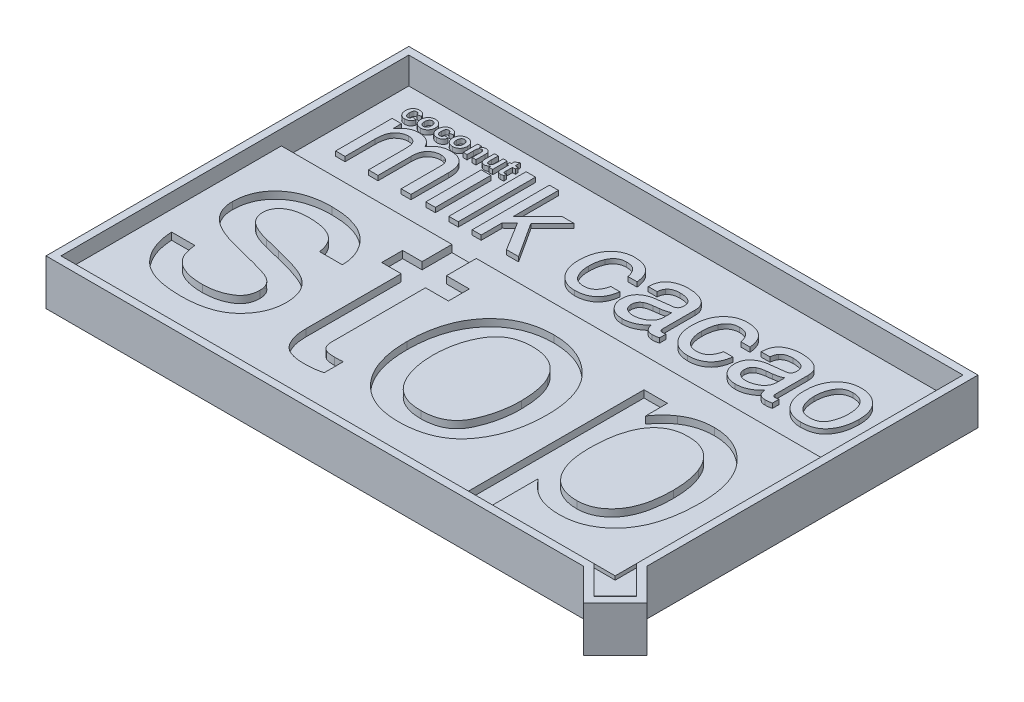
from build123d import *

# Parameters (mm, degrees)
SCHIZZO1_W                    = 144
SCHIZZO1_H                    = 54.86
ESTRUSIONE_ESTRUSIONE1_DEPTH  = 8.2
SCHIZZO1_3_W                  = 144
SCHIZZO1_3_H                  = 34.02
ESTRUSIONE_ESTRUSIONE2_DEPTH  = 5.05
TAGLIO_ESTRUSIONE1_DEPTH      = 1.91
SCHIZZO3_W                    = 2.550748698
SCHIZZO3_H                    = 14.816666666
SCHIZZO3_H_2                  = 2.910416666
SCHIZZO3_W_2                  = 2.513541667
SCHIZZO3_H_3                  = 20.6375
ESTRUSIONE_ESTRUSIONE3_DEPTH  = 1.24
SCHIZZO4_W                    = 148
SCHIZZO4_H                    = 92.88
ESTRUSIONE_ESTRUSIONE4_DEPTH  = 10.2
SCHIZZO9_W                    = 152
SCHIZZO9_H                    = 96.88
ESTRUSIONE_ESTRUSIONE7_DEPTH  = 12.2
SCHIZZO11_W                   = 2.550748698
SCHIZZO11_H                   = 2.910416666
TAGLIO_ESTRUSIONE2_DEPTH      = 10
ESTRUSIONE_ESTRUSIONE8_DEPTH  = 1.24
ESTRUSIONE_ESTRUSIONE9_DEPTH  = 12.2
TAGLIO_ESTRUSIONE3_DEPTH      = 1
ESTRUSIONE_ESTRUSIONE10_REACH = 121.982


with BuildPart() as part:
    # Schizzo1 → Estrusione-Estrusione1 (new body)
    with BuildSketch(Plane(origin=(0, 0, 0), x_dir=(1, 0, 0), z_dir=(0, 1, 0))):
        with Locations((72, 27.43)):
            Rectangle(SCHIZZO1_W, SCHIZZO1_H)
    extrude(amount=ESTRUSIONE_ESTRUSIONE1_DEPTH)

    # Schizzo1_3 → Estrusione-Estrusione2 (add)
    with BuildSketch(Plane(origin=(0, 0, 0), x_dir=(1, 0, 0), z_dir=(0, 1, 0))):
        with Locations((72, 71.87)):
            Rectangle(SCHIZZO1_3_W, SCHIZZO1_3_H)
    extrude(amount=ESTRUSIONE_ESTRUSIONE2_DEPTH)

    # Schizzo2 → Taglio-Estrusione1 (cut)
    # profile 1 of 4: a face of its own
    with BuildSketch(Plane(origin=(0, 8.2, 0), x_dir=(1, 0, 0), z_dir=(0, 1, 0))):
        with BuildLine():
            add(Edge.make_bspline(
                [(11.451305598, 20.283169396), (11.510179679, 19.779292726), (11.622027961, 18.82203379), (11.963314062, 17.491104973), (12.412287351, 16.33001977), (12.852804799, 15.683204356), (13.062550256, 15.375233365)],
                knots=[0, 0, 0, 0, 1.162844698, 2.209158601, 3.147319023, 4, 4, 4, 4], degree=3))
            add(Edge.make_bspline(
                [(13.062550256, 15.375233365), (13.278695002, 15.128537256), (13.715169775, 14.630368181), (14.497541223, 13.993574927), (15.393433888, 13.455460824), (16.402451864, 13.029278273), (17.520667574, 12.685902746), (18.749676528, 12.446263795), (20.091163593, 12.313538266), (21.019546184, 12.291409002), (21.500384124, 12.279947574)],
                knots=[0, 0, 0, 0, 0.845220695, 1.706807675, 2.590309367, 3.533742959, 4.525884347, 5.604157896, 6.75911958, 8, 8, 8, 8], degree=3))
            add(Edge.make_bspline(
                [(21.500384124, 12.279947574), (22.081336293, 12.296038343), (23.215927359, 12.327463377), (24.856100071, 12.637349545), (26.393612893, 13.109232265), (27.573370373, 13.676186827), (28.437358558, 14.218708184), (28.985724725, 14.705010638), (29.473647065, 15.21998201), (29.85726381, 15.803510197), (30.160095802, 16.437642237), (30.366871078, 17.127992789), (30.499144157, 17.868326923), (30.513733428, 18.378057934), (30.52123415, 18.640123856)],
                knots=[0, 0, 0, 0, 1.68819334, 3.29701683, 4.837885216, 6.354950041, 7.090484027, 7.797305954, 8.481109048, 9.148176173, 9.819427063, 10.51843358, 11.23828831, 12, 12, 12, 12], degree=3))
            add(Edge.make_bspline(
                [(30.52123415, 18.640123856), (30.516298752, 18.838519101), (30.506616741, 19.227720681), (30.396351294, 19.790407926), (30.225501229, 20.317366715), (29.990958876, 20.811920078), (29.682112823, 21.271068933), (29.295618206, 21.684339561), (28.845136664, 22.05954559), (28.50976309, 22.272626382), (28.337573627, 22.382027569)],
                knots=[0, 0, 0, 0, 1.043711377, 2.04749927, 3.006824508, 3.955803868, 4.921068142, 5.90885562, 6.926352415, 8, 8, 8, 8], degree=3))
            add(Edge.make_bspline(
                [(28.337573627, 22.382027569), (28.207534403, 22.450565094), (27.923535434, 22.60024752), (27.446219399, 22.810695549), (26.881100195, 23.018934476), (26.234358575, 23.241772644), (25.502208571, 23.47319379), (24.687484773, 23.719298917), (23.784271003, 23.959396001), (23.15415323, 24.120979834), (22.825420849, 24.205278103)],
                knots=[0, 0, 0, 0, 0.606219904, 1.323953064, 2.149595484, 3.089877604, 4.145430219, 5.316697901, 6.600121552, 8, 8, 8, 8], degree=3))
            Line((22.825420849, 24.205278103), (17.705478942, 25.487913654))
            add(Edge.make_bspline(
                [(17.705478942, 25.487913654), (16.938938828, 25.685545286), (15.503356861, 26.055671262), (13.541301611, 26.73393632), (11.873512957, 27.393822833), (10.923177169, 27.947349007), (10.486678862, 28.201588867)],
                knots=[0, 0, 0, 0, 1.226579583, 2.29714727, 3.217863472, 4, 4, 4, 4], degree=3))
            add(Edge.make_bspline(
                [(10.486678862, 28.201588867), (10.154796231, 28.418840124), (9.508368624, 28.841993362), (8.673606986, 29.611257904), (7.93853145, 30.411904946), (7.352641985, 31.294065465), (6.887091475, 32.232393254), (6.576614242, 33.242911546), (6.361830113, 34.308907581), (6.341660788, 35.044728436), (6.331363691, 35.420388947)],
                knots=[0, 0, 0, 0, 1.088627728, 2.120385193, 3.110991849, 4.070093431, 5.021490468, 5.97995237, 6.968699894, 8, 8, 8, 8], degree=3))
            add(Edge.make_bspline(
                [(6.331363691, 35.420388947), (6.344201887, 35.862610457), (6.369371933, 36.729611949), (6.548311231, 37.996232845), (6.862581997, 39.194790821), (7.28010221, 40.334141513), (7.842541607, 41.40511209), (8.519439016, 42.412957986), (9.324197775, 43.350566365), (10.234359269, 44.220298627), (11.25494653, 45.003966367), (12.364490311, 45.693814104), (13.568729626, 46.267581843), (14.847339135, 46.747123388), (16.216899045, 47.101764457), (17.665076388, 47.369168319), (19.200098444, 47.528436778), (20.252711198, 47.547825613), (20.790164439, 47.557725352)],
                knots=[0, 0, 0, 0, 0.999303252, 1.959193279, 2.883033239, 3.795204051, 4.695235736, 5.609919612, 6.533207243, 7.482073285, 8.449967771, 9.43607122, 10.428941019, 11.459809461, 12.517362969, 13.621550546, 14.785588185, 16, 16, 16, 16], degree=3))
            add(Edge.make_bspline(
                [(20.790164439, 47.557725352), (21.486809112, 47.540339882), (22.83471354, 47.506701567), (24.782109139, 47.280478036), (26.573452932, 46.873195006), (28.222634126, 46.32970349), (29.719352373, 45.604459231), (31.06129139, 44.71601267), (32.277149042, 43.689685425), (32.936296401, 42.869914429), (33.266710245, 42.458984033)],
                knots=[0, 0, 0, 0, 1.195035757, 2.312217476, 3.356218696, 4.341416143, 5.284781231, 6.199295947, 7.097352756, 8, 8, 8, 8], degree=3))
            add(Edge.make_bspline(
                [(33.266710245, 42.458984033), (33.457613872, 42.189394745), (33.833450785, 41.658647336), (34.327610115, 40.829674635), (34.722539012, 39.975389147), (35.077041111, 39.119228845), (35.308300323, 38.232315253), (35.49883732, 37.339197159), (35.592214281, 36.42593569), (35.59658337, 35.812757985), (35.598774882, 35.505191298)],
                knots=[0, 0, 0, 0, 1.06071571, 2.088258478, 3.093248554, 4.081507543, 5.058826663, 6.03132503, 7.012523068, 8, 8, 8, 8], degree=3))
            Line((35.598774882, 35.505191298), (29.514206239, 35.505191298))
            add(Edge.make_bspline(
                [(29.514206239, 35.505191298), (29.47349145, 35.861122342), (29.392663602, 36.567724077), (29.053206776, 37.582660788), (28.606320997, 38.561871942), (28.188608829, 39.150525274), (27.977163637, 39.448500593)],
                knots=[0, 0, 0, 0, 0.999776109, 1.98477639, 2.979897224, 4, 4, 4, 4], degree=3))
            add(Edge.make_bspline(
                [(27.977163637, 39.448500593), (27.782073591, 39.65352166), (27.385756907, 40.070012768), (26.658824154, 40.572478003), (25.845830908, 41.012083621), (24.9278869, 41.371996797), (23.906972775, 41.64403327), (22.785026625, 41.829781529), (21.566459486, 41.946989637), (20.719779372, 41.963052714), (20.281350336, 41.971370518)],
                knots=[0, 0, 0, 0, 0.812533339, 1.65062505, 2.52872269, 3.469083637, 4.480436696, 5.563713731, 6.738438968, 8, 8, 8, 8], degree=3))
            add(Edge.make_bspline(
                [(20.281350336, 41.971370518), (19.707610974, 41.958812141), (18.630817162, 41.935242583), (17.125268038, 41.666703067), (15.829177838, 41.246247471), (14.761709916, 40.627205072), (13.928510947, 39.861664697), (13.308666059, 38.98613815), (12.943571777, 37.973735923), (12.903145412, 37.260700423), (12.882345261, 36.893829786)],
                knots=[0, 0, 0, 0, 1.365157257, 2.562126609, 3.629448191, 4.59516368, 5.476703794, 6.305518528, 7.128156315, 8, 8, 8, 8], degree=3))
            add(Edge.make_bspline(
                [(12.882345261, 36.893829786), (12.890624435, 36.688260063), (12.906751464, 36.287830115), (13.029738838, 35.70349674), (13.219618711, 35.15029381), (13.487020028, 34.623233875), (13.838750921, 34.134709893), (14.274370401, 33.687705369), (14.772259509, 33.255978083), (15.154348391, 33.012832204), (15.352213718, 32.886918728)],
                knots=[0, 0, 0, 0, 0.998287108, 1.944566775, 2.889443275, 3.834007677, 4.806108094, 5.802029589, 6.861777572, 8, 8, 8, 8], degree=3))
            add(Edge.make_bspline(
                [(15.352213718, 32.886918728), (15.618263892, 32.737105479), (16.189341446, 32.415530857), (17.166727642, 32.006731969), (18.309077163, 31.629765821), (19.135027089, 31.418842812), (19.571130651, 31.307474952)],
                knots=[0, 0, 0, 0, 0.809787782, 1.738212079, 2.805770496, 4, 4, 4, 4], degree=3))
            Line((19.571130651, 31.307474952), (23.821848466, 30.268646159))
            add(Edge.make_bspline(
                [(23.821848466, 30.268646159), (24.377210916, 30.13325261), (25.444736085, 29.87299731), (26.968430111, 29.460770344), (28.348267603, 29.050892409), (29.57968182, 28.634003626), (30.675469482, 28.23601682), (31.628849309, 27.836663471), (32.43892558, 27.440284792), (32.911716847, 27.148428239), (33.128906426, 27.014355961)],
                knots=[0, 0, 0, 0, 1.386045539, 2.664275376, 3.827148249, 4.875695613, 5.816335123, 6.653364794, 7.381386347, 8, 8, 8, 8], degree=3))
            add(Edge.make_bspline(
                [(33.128906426, 27.014355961), (33.428928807, 26.803618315), (34.021787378, 26.387190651), (34.786111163, 25.622491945), (35.438988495, 24.779011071), (35.979071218, 23.847800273), (36.373838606, 22.817827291), (36.67713586, 21.711338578), (36.84192573, 20.510649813), (36.8679522, 19.682945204), (36.881410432, 19.254940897)],
                knots=[0, 0, 0, 0, 0.97493506, 1.926518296, 2.865783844, 3.810080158, 4.781694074, 5.795241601, 6.859924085, 8, 8, 8, 8], degree=3))
            add(Edge.make_bspline(
                [(36.881410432, 19.254940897), (36.869064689, 18.833747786), (36.844776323, 18.005114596), (36.655598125, 16.784163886), (36.365370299, 15.605358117), (35.93554858, 14.471674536), (35.379372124, 13.387360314), (34.707574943, 12.344126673), (33.9173715, 11.342129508), (33.011259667, 10.391421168), (31.978414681, 9.512244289), (30.810172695, 8.751320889), (29.510947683, 8.108953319), (28.085095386, 7.599609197), (26.541781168, 7.177895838), (24.864773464, 6.905107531), (23.066531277, 6.71542403), (21.822471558, 6.701009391), (21.182375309, 6.69359274)],
                knots=[0, 0, 0, 0, 0.892981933, 1.756805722, 2.61475753, 3.463858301, 4.321908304, 5.195045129, 6.09163648, 7.024577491, 7.976500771, 8.961796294, 9.974001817, 11.043306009, 12.168634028, 13.362548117, 14.642972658, 16, 16, 16, 16], degree=3))
            add(Edge.make_bspline(
                [(21.182375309, 6.69359274), (20.496517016, 6.70603135), (19.171769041, 6.730056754), (17.261064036, 6.906708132), (15.506273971, 7.212203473), (13.903015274, 7.631817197), (12.452493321, 8.178976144), (11.160464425, 8.860103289), (10.022009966, 9.656696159), (9.050215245, 10.582815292), (8.218927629, 11.595688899), (7.480762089, 12.662862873), (6.841001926, 13.788891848), (6.312045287, 14.979265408), (5.886516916, 16.224494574), (5.567757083, 17.526240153), (5.355661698, 18.885039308), (5.292687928, 19.812540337), (5.260734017, 20.283169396)],
                knots=[0, 0, 0, 0, 1.388232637, 2.681397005, 3.879635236, 4.989989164, 6.031397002, 7.010442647, 7.939183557, 8.834722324, 9.718444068, 10.58742611, 11.458612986, 12.335885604, 13.220272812, 14.118862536, 15.045480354, 16, 16, 16, 16], degree=3))
            Line((5.260734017, 20.283169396), (11.451305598, 20.283169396))
        make_face()
    # profile 2 of 4: a face of its own
    with BuildSketch(Plane(origin=(0, 8.2, 0), x_dir=(1, 0, 0), z_dir=(0, 1, 0))):
        with BuildLine():
            Line((45.54185047, 57.235793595), (52.050430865, 57.235793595))
            Line((52.050430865, 57.235793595), (52.050430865, 46.879306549))
            Line((52.050430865, 46.879306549), (58.16680039, 46.879306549))
            Line((58.16680039, 46.879306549), (58.16680039, 41.292951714))
            Line((58.16680039, 41.292951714), (52.050430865, 41.292951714))
            Line((52.050430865, 41.292951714), (52.050430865, 16.202056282))
            add(Edge.make_bspline(
                [(52.050430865, 16.202056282), (52.063666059, 15.892402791), (52.088254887, 15.317117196), (52.345568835, 14.529027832), (52.79000554, 13.897322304), (53.209173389, 13.638462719), (53.417868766, 13.509581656)],
                knots=[0, 0, 0, 0, 1.162812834, 2.160316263, 3.084057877, 4, 4, 4, 4], degree=3))
            add(Edge.make_bspline(
                [(53.417868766, 13.509581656), (53.561268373, 13.448583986), (53.881725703, 13.312271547), (54.451882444, 13.196654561), (55.143699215, 13.124141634), (55.647194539, 13.119747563), (55.919538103, 13.117370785)],
                knots=[0, 0, 0, 0, 0.731223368, 1.634076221, 2.720257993, 4, 4, 4, 4], degree=3))
            add(Edge.make_bspline(
                [(55.919538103, 13.117370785), (56.082078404, 13.117610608), (56.414225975, 13.11810068), (56.940794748, 13.114114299), (57.528668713, 13.132487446), (57.94442834, 13.177889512), (58.16680039, 13.202173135)],
                knots=[0, 0, 0, 0, 0.866610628, 1.770899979, 2.807749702, 4, 4, 4, 4], degree=3))
            Line((58.16680039, 13.202173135), (58.16680039, 8.124632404))
            add(Edge.make_bspline(
                [(58.16680039, 8.124632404), (57.793823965, 8.025309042), (57.037099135, 7.823793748), (55.845976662, 7.655789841), (54.58612293, 7.544398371), (53.718498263, 7.535579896), (53.269464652, 7.531015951)],
                knots=[0, 0, 0, 0, 0.93504676, 1.897098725, 2.911656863, 4, 4, 4, 4], degree=3))
            add(Edge.make_bspline(
                [(53.269464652, 7.531015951), (52.908601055, 7.534323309), (52.216564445, 7.540665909), (51.225206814, 7.665922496), (50.317816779, 7.837545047), (49.501992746, 8.093950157), (48.766222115, 8.404539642), (48.138542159, 8.81750984), (47.585005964, 9.281726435), (46.987453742, 10.025334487), (46.412488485, 11.099089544), (45.891042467, 12.528591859), (45.602673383, 14.137791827), (45.56269766, 15.264613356), (45.54185047, 15.852246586)],
                knots=[0, 0, 0, 0, 0.990359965, 1.899236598, 2.740516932, 3.523277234, 4.244603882, 4.925699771, 5.579416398, 6.220621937, 7.532801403, 8.905085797, 10.386013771, 12, 12, 12, 12], degree=3))
            Line((45.54185047, 15.852246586), (45.54185047, 41.292951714))
            Line((45.54185047, 41.292951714), (40.3583068, 41.292951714))
            Line((40.3583068, 41.292951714), (40.3583068, 46.879306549))
            Line((40.3583068, 46.879306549), (45.54185047, 46.879306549))
            Line((45.54185047, 46.879306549), (45.54185047, 57.235793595))
        make_face()
    # profile 3 of 4: a face of its own
    with BuildSketch(Plane(origin=(0, 8.2, 0), x_dir=(1, 0, 0), z_dir=(0, 1, 0))):
        with BuildLine():
            add(Edge.make_bspline(
                [(80.067007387, 47.557725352), (80.6719149, 47.544390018), (81.865177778, 47.518084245), (83.616643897, 47.282566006), (85.290861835, 46.881068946), (86.904324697, 46.361726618), (88.434272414, 45.647293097), (89.905654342, 44.805668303), (91.286475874, 43.781867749), (92.602168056, 42.636407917), (93.805543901, 41.333998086), (94.849470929, 39.869154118), (95.732903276, 38.256635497), (96.451845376, 36.498649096), (97.013577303, 34.598501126), (97.414901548, 32.554868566), (97.644361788, 30.362227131), (97.677977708, 28.852280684), (97.695295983, 28.074385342)],
                knots=[0, 0, 0, 0, 0.979011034, 1.931233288, 2.853942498, 3.763848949, 4.669989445, 5.582463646, 6.503522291, 7.447946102, 8.403410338, 9.366974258, 10.352647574, 11.373530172, 12.435943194, 13.55556833, 14.740675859, 16, 16, 16, 16], degree=3))
            add(Edge.make_bspline(
                [(97.695295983, 28.074385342), (97.680935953, 27.317716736), (97.652828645, 25.836667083), (97.435958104, 23.665400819), (97.088347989, 21.592874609), (96.606041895, 19.615586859), (95.967181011, 17.744242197), (95.190259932, 15.974673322), (94.275408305, 14.301652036), (93.223622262, 12.73340954), (92.019192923, 11.305727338), (90.649352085, 10.061817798), (89.120874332, 9.017183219), (87.436978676, 8.165941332), (85.603243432, 7.491307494), (83.604056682, 7.037996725), (81.457361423, 6.743064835), (79.972644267, 6.710404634), (79.208383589, 6.69359274)],
                knots=[0, 0, 0, 0, 1.131798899, 2.215303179, 3.260719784, 4.273528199, 5.256431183, 6.214997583, 7.161242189, 8.105402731, 9.035369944, 9.94847908, 10.864841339, 11.796264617, 12.764517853, 13.779985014, 14.857243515, 16, 16, 16, 16], degree=3))
            add(Edge.make_bspline(
                [(79.208383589, 6.69359274), (78.564356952, 6.70876231), (77.306386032, 6.738392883), (75.475185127, 7.002018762), (73.743069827, 7.410274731), (72.11122218, 7.997528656), (70.577746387, 8.747994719), (69.154523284, 9.682932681), (67.8371688, 10.783161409), (66.615545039, 12.031716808), (65.530393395, 13.429496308), (64.578344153, 14.949203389), (63.771462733, 16.581350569), (63.126621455, 18.335861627), (62.619190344, 20.198165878), (62.246463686, 22.171624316), (62.036742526, 24.264314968), (62.008179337, 25.695923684), (61.993506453, 26.431339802)],
                knots=[0, 0, 0, 0, 1.045449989, 2.042067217, 2.998295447, 3.931322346, 4.852681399, 5.764717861, 6.689786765, 7.635347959, 8.596180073, 9.557902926, 10.543421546, 11.547561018, 12.588923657, 13.67505307, 14.805676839, 16, 16, 16, 16], degree=3))
            add(Edge.make_bspline(
                [(61.993506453, 26.431339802), (62.005975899, 27.216428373), (62.030355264, 28.751377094), (62.272230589, 30.989935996), (62.642891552, 33.109227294), (63.193376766, 35.097954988), (63.86000983, 36.977470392), (64.716162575, 38.720680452), (65.71830852, 40.342384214), (66.859428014, 41.839649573), (68.13885565, 43.179288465), (69.524816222, 44.362566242), (71.027527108, 45.348058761), (72.632242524, 46.164854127), (74.345690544, 46.78855836), (76.162589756, 47.229275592), (78.079062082, 47.517902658), (79.394575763, 47.544255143), (80.067007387, 47.557725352)],
                knots=[0, 0, 0, 0, 1.201498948, 2.349084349, 3.443041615, 4.491558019, 5.504617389, 6.491693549, 7.45846115, 8.419232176, 9.36812766, 10.289327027, 11.203031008, 12.112658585, 13.040220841, 13.987480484, 14.971290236, 16, 16, 16, 16], degree=3))
        make_face()
        with BuildLine():
            add(Edge.make_bspline(
                [(79.812600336, 12.279947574), (80.326158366, 12.291401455), (81.316618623, 12.313491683), (82.736451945, 12.560964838), (84.044957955, 12.912166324), (85.210016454, 13.471566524), (86.268440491, 14.143784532), (87.175882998, 15.003015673), (87.97126354, 15.99509394), (88.613259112, 17.138935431), (89.16472182, 18.357817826), (89.641567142, 19.628258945), (90.055154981, 20.929402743), (90.398714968, 22.266058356), (90.645042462, 23.638529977), (90.843829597, 25.037788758), (90.944997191, 26.475794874), (90.964717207, 27.445309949), (90.974709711, 27.936581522)],
                knots=[0, 0, 0, 0, 1.12999463, 2.179334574, 3.167289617, 4.104025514, 5.015119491, 5.91839908, 6.843517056, 7.806124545, 8.798851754, 9.789165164, 10.793572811, 11.805492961, 12.826859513, 13.863856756, 14.917575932, 16, 16, 16, 16], degree=3))
            add(Edge.make_bspline(
                [(90.974709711, 27.936581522), (90.966825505, 28.374776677), (90.951491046, 29.227048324), (90.883759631, 30.476822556), (90.739041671, 31.660325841), (90.568051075, 32.78826358), (90.321551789, 33.849623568), (90.022816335, 34.850770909), (89.682209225, 35.793990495), (89.396710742, 36.383632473), (89.257462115, 36.671223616)],
                knots=[0, 0, 0, 0, 1.171061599, 2.277666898, 3.342189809, 4.355754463, 5.324533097, 6.250549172, 7.146725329, 8, 8, 8, 8], degree=3))
            add(Edge.make_bspline(
                [(89.257462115, 36.671223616), (89.021920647, 37.092303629), (88.560283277, 37.917577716), (87.679399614, 39.003799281), (86.68616603, 39.929005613), (85.56295352, 40.683576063), (84.314612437, 41.266683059), (82.943660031, 41.678906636), (81.453851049, 41.924530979), (80.421313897, 41.955393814), (79.886802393, 41.971370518)],
                knots=[0, 0, 0, 0, 1.015161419, 1.989613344, 2.932755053, 3.866177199, 4.828780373, 5.825089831, 6.874118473, 8, 8, 8, 8], degree=3))
            add(Edge.make_bspline(
                [(79.886802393, 41.971370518), (79.412476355, 41.957260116), (78.49066435, 41.929837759), (77.156553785, 41.713691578), (75.919608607, 41.367458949), (74.781105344, 40.879236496), (73.749160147, 40.234100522), (72.82676077, 39.439959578), (71.985178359, 38.522382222), (71.27670097, 37.456786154), (70.659912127, 36.298985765), (70.102766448, 35.084836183), (69.654548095, 33.803818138), (69.262790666, 32.4766349), (68.985746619, 31.080945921), (68.771563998, 29.630927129), (68.642033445, 28.119130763), (68.626569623, 27.092341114), (68.61869008, 26.569143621)],
                knots=[0, 0, 0, 0, 1.05663293, 2.053475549, 3.003171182, 3.913086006, 4.804550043, 5.703943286, 6.618209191, 7.57048043, 8.546484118, 9.54033639, 10.544121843, 11.568453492, 12.621706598, 13.71195964, 14.834136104, 16, 16, 16, 16], degree=3))
            add(Edge.make_bspline(
                [(68.61869008, 26.569143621), (68.626753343, 26.070688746), (68.642621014, 25.089780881), (68.769643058, 23.651694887), (68.987027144, 22.276252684), (69.26128364, 20.960789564), (69.652583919, 19.717980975), (70.103718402, 18.529094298), (70.657860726, 17.412452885), (71.27663978, 16.355980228), (71.993627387, 15.398094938), (72.820826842, 14.560210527), (73.743050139, 13.848185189), (74.767294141, 13.267201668), (75.89137343, 12.821022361), (77.113401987, 12.509006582), (78.431775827, 12.312647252), (79.341925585, 12.29109375), (79.812600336, 12.279947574)],
                knots=[0, 0, 0, 0, 1.162953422, 2.288572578, 3.364829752, 4.411112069, 5.420357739, 6.401774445, 7.375193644, 8.325361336, 9.255355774, 10.158993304, 11.064321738, 11.965247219, 12.89761405, 13.877471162, 14.902355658, 16, 16, 16, 16], degree=3))
        make_face(mode=Mode.SUBTRACT)
    # profile 4 of 4: a face of its own
    with BuildSketch(Plane(origin=(0, 8.2, 0), x_dir=(1, 0, 0), z_dir=(0, 1, 0))):
        with BuildLine():
            Line((104.808093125, 46.879306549), (111.072866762, 46.879306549))
            Line((111.072866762, 46.879306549), (111.072866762, 41.038544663))
            add(Edge.make_bspline(
                [(111.072866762, 41.038544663), (111.39302975, 41.480010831), (112.015986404, 42.338992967), (113.063831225, 43.47757047), (114.130578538, 44.487797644), (114.910214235, 45.033019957), (115.291783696, 45.299862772)],
                knots=[0, 0, 0, 0, 1.084134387, 2.109452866, 3.074728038, 4, 4, 4, 4], degree=3))
            add(Edge.make_bspline(
                [(115.291783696, 45.299862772), (115.564128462, 45.4819966), (116.108643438, 45.846147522), (116.984373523, 46.294250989), (117.887124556, 46.693841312), (118.831737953, 47.00985104), (119.81111016, 47.25128084), (120.82300913, 47.434660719), (121.872213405, 47.541979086), (122.58454225, 47.552432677), (122.945195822, 47.557725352)],
                knots=[0, 0, 0, 0, 0.969200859, 1.937780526, 2.90754576, 3.8900351, 4.882056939, 5.891628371, 6.932527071, 8, 8, 8, 8], degree=3))
            add(Edge.make_bspline(
                [(122.945195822, 47.557725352), (123.479816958, 47.545963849), (124.533676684, 47.522779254), (126.077715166, 47.26418012), (127.562026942, 46.877650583), (128.983075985, 46.318674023), (130.340400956, 45.607694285), (131.63918096, 44.738865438), (132.864494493, 43.704411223), (134.032793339, 42.530056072), (135.101643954, 41.212281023), (136.035374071, 39.745868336), (136.799425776, 38.133587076), (137.45442038, 36.399552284), (137.947520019, 34.526899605), (138.29277316, 32.519300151), (138.506711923, 30.379269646), (138.53454204, 28.905255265), (138.548828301, 28.148587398)],
                knots=[0, 0, 0, 0, 0.917146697, 1.807904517, 2.680626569, 3.54706212, 4.423635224, 5.307089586, 6.224537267, 7.172688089, 8.147732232, 9.132394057, 10.150002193, 11.205957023, 12.311222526, 13.469314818, 14.700902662, 16, 16, 16, 16], degree=3))
            add(Edge.make_bspline(
                [(138.548828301, 28.148587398), (138.529140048, 27.133667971), (138.491107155, 25.173091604), (138.182349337, 22.347023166), (137.680198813, 19.744898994), (136.975194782, 17.364175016), (136.054984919, 15.20200917), (134.909218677, 13.275444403), (133.591463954, 11.540373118), (132.526528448, 10.589529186), (131.99784673, 10.117487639)],
                knots=[0, 0, 0, 0, 1.228758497, 2.373661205, 3.437696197, 4.434002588, 5.375074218, 6.274740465, 7.143503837, 8, 8, 8, 8], degree=3))
            add(Edge.make_bspline(
                [(131.99784673, 10.117487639), (131.649820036, 9.841407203), (130.961970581, 9.295754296), (129.846877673, 8.615986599), (128.712240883, 8.006001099), (127.515924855, 7.538239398), (126.28640744, 7.146978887), (125.006777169, 6.888086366), (123.688053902, 6.722765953), (122.793766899, 6.703398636), (122.340979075, 6.69359274)],
                knots=[0, 0, 0, 0, 1.018312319, 2.012620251, 2.991739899, 3.970322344, 4.955031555, 5.948810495, 6.961459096, 8, 8, 8, 8], degree=3))
            add(Edge.make_bspline(
                [(122.340979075, 6.69359274), (121.646603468, 6.713694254), (120.308405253, 6.752433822), (118.391261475, 7.112966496), (116.632110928, 7.678644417), (115.590975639, 8.269254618), (115.07977782, 8.559244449)],
                knots=[0, 0, 0, 0, 1.096236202, 2.112662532, 3.073316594, 4, 4, 4, 4], degree=3))
            add(Edge.make_bspline(
                [(115.07977782, 8.559244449), (114.781371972, 8.757486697), (114.138367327, 9.184658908), (113.220465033, 10.02052939), (112.22738304, 11.013535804), (111.589917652, 11.77275976), (111.253071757, 12.173944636)],
                knots=[0, 0, 0, 0, 0.81235574, 1.750463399, 2.811312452, 4, 4, 4, 4], degree=3))
            Line((111.253071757, 12.173944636), (111.253071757, -7.394197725))
            Line((111.253071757, -7.394197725), (104.808093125, -7.394197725))
            Line((104.808093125, -7.394197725), (104.808093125, 46.879306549))
        make_face()
        with BuildLine():
            add(Edge.make_bspline(
                [(121.482355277, 12.279947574), (121.850574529, 12.292616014), (122.577334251, 12.317619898), (123.641315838, 12.502411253), (124.655753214, 12.799221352), (125.622569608, 13.216356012), (126.536441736, 13.764407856), (127.409537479, 14.422992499), (128.231181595, 15.207892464), (129.003393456, 16.105825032), (129.706397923, 17.1257407), (130.31130904, 18.273483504), (130.826420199, 19.534289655), (131.255990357, 20.91242382), (131.563474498, 22.412390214), (131.793790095, 24.026548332), (131.949529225, 25.756973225), (131.960427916, 26.950398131), (131.966045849, 27.565571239)],
                knots=[0, 0, 0, 0, 0.850156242, 1.677965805, 2.486235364, 3.286721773, 4.102700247, 4.94165832, 5.807571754, 6.721969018, 7.672717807, 8.662120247, 9.712388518, 10.814608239, 11.991067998, 13.244467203, 14.579609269, 16, 16, 16, 16], degree=3))
            add(Edge.make_bspline(
                [(131.966045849, 27.565571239), (131.950225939, 28.311920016), (131.919620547, 29.755815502), (131.672031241, 31.841198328), (131.278696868, 33.773231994), (130.849093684, 34.968599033), (130.641009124, 35.547592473)],
                knots=[0, 0, 0, 0, 1.100355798, 2.128761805, 3.09363852, 4, 4, 4, 4], degree=3))
            add(Edge.make_bspline(
                [(130.641009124, 35.547592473), (130.424647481, 36.055867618), (130.007241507, 37.036434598), (129.182813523, 38.358468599), (128.217910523, 39.474408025), (127.130523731, 40.402432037), (125.899890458, 41.11150056), (124.5408171, 41.608651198), (123.055289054, 41.927266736), (122.017606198, 41.956362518), (121.482355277, 41.971370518)],
                knots=[0, 0, 0, 0, 1.103961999, 2.12976907, 3.102005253, 4.045125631, 4.976301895, 5.926942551, 6.930688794, 8, 8, 8, 8], degree=3))
            add(Edge.make_bspline(
                [(121.482355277, 41.971370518), (120.943578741, 41.952615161), (119.901847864, 41.916351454), (118.408415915, 41.59187811), (117.049044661, 41.058066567), (115.822200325, 40.30404798), (114.728119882, 39.333388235), (113.76907425, 38.151198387), (112.943235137, 36.75787771), (112.535400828, 35.723901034), (112.323701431, 35.187182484)],
                knots=[0, 0, 0, 0, 1.053999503, 2.037920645, 2.975880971, 3.901509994, 4.842731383, 5.826141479, 6.871589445, 8, 8, 8, 8], degree=3))
            add(Edge.make_bspline(
                [(112.323701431, 35.187182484), (112.114866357, 34.54435368), (111.676898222, 33.19621552), (111.288526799, 30.995118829), (111.043495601, 28.560660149), (111.014055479, 26.856061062), (110.998664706, 25.964926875)],
                knots=[0, 0, 0, 0, 0.865599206, 1.815331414, 2.857893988, 4, 4, 4, 4], degree=3))
            add(Edge.make_bspline(
                [(110.998664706, 25.964926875), (111.014181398, 25.239727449), (111.044023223, 23.845018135), (111.292355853, 21.837037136), (111.685604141, 19.988825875), (112.115583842, 18.851432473), (112.323701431, 18.300914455)],
                knots=[0, 0, 0, 0, 1.111573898, 2.137787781, 3.098657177, 4, 4, 4, 4], degree=3))
            add(Edge.make_bspline(
                [(112.323701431, 18.300914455), (112.539099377, 17.82317649), (112.956687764, 16.896993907), (113.802104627, 15.671964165), (114.746692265, 14.609345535), (115.84415661, 13.753592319), (117.071496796, 13.083655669), (118.432064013, 12.62634407), (119.914737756, 12.327744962), (120.947256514, 12.296262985), (121.482355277, 12.279947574)],
                knots=[0, 0, 0, 0, 1.071677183, 2.07764259, 3.036010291, 3.974456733, 4.913907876, 5.886928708, 6.90490916, 8, 8, 8, 8], degree=3))
        make_face(mode=Mode.SUBTRACT)
    extrude(amount=-TAGLIO_ESTRUSIONE1_DEPTH, mode=Mode.SUBTRACT)

    # Schizzo3 → Estrusione-Estrusione3 (add)
    # profile 1 of 10: a face of its own
    with BuildSketch(Plane(origin=(0, 5.05, 0), x_dir=(1, 0, 0), z_dir=(0, 1, 0))):
        with BuildLine():
            Line((6.5011214, 77.925467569), (8.98159015, 77.925467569))
            Line((8.98159015, 77.925467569), (8.98159015, 75.676509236))
            add(Edge.make_bspline(
                [(8.98159015, 75.676509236), (9.126093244, 75.852859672), (9.39981136, 76.186903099), (9.812458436, 76.640754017), (10.206260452, 77.01634958), (10.476396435, 77.2220058), (10.602163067, 77.317752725)],
                knots=[0, 0, 0, 0, 1.182504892, 2.239903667, 3.180555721, 4, 4, 4, 4], degree=3))
            add(Edge.make_bspline(
                [(10.602163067, 77.317752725), (10.811839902, 77.452010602), (11.229323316, 77.719328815), (11.92555473, 77.986928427), (12.659085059, 78.162560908), (13.164254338, 78.180772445), (13.421629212, 78.190050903)],
                knots=[0, 0, 0, 0, 0.994667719, 1.980463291, 2.971081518, 4, 4, 4, 4], degree=3))
            add(Edge.make_bspline(
                [(13.421629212, 78.190050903), (13.566467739, 78.188541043), (13.850023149, 78.185585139), (14.26420877, 78.136907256), (14.657795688, 78.067174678), (15.031597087, 77.975078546), (15.381218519, 77.845004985), (15.707813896, 77.686479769), (16.017265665, 77.507407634), (16.202709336, 77.361367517), (16.294838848, 77.288813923)],
                knots=[0, 0, 0, 0, 1.130492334, 2.213204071, 3.251854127, 4.251581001, 5.215203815, 6.158662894, 7.085212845, 8, 8, 8, 8], degree=3))
            add(Edge.make_bspline(
                [(16.294838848, 77.288813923), (16.396095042, 77.194346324), (16.607606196, 76.99701567), (16.89680747, 76.647411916), (17.16512166, 76.232388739), (17.326517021, 75.929982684), (17.411049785, 75.771593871)],
                knots=[0, 0, 0, 0, 0.876173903, 1.830214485, 2.863548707, 4, 4, 4, 4], degree=3))
            add(Edge.make_bspline(
                [(17.411049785, 75.771593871), (17.551010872, 75.966994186), (17.824510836, 76.34882874), (18.305450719, 76.844410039), (18.814803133, 77.269469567), (19.368032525, 77.606370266), (19.955539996, 77.869664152), (20.579760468, 78.054574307), (21.237740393, 78.169793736), (21.688000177, 78.183216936), (21.917234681, 78.190050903)],
                knots=[0, 0, 0, 0, 1.078638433, 2.107782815, 3.093251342, 4.05219927, 5.008444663, 5.978127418, 6.970632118, 8, 8, 8, 8], degree=3))
            add(Edge.make_bspline(
                [(21.917234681, 78.190050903), (22.158820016, 78.184689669), (22.623730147, 78.174372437), (23.290864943, 78.068194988), (23.900619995, 77.901239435), (24.451741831, 77.662638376), (24.938497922, 77.347096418), (25.364118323, 76.966011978), (25.73680738, 76.520173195), (25.923275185, 76.177624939), (26.018276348, 76.003104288)],
                knots=[0, 0, 0, 0, 1.177491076, 2.265979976, 3.285279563, 4.254388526, 5.182856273, 6.101638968, 7.032827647, 8, 8, 8, 8], degree=3))
            add(Edge.make_bspline(
                [(26.018276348, 76.003104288), (26.065459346, 75.901834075), (26.162742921, 75.69303157), (26.278724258, 75.358486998), (26.38476916, 75.000638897), (26.465876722, 74.616199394), (26.526714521, 74.205968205), (26.571461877, 73.771447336), (26.60202954, 73.312231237), (26.604205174, 72.997655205), (26.605320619, 72.836372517)],
                knots=[0, 0, 0, 0, 0.825006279, 1.701027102, 2.612941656, 3.581532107, 4.601070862, 5.676048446, 6.808513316, 8, 8, 8, 8], degree=3))
            Line((26.605320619, 72.836372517), (26.605320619, 62.844217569))
            Line((26.605320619, 62.844217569), (23.996694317, 62.844217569))
            Line((23.996694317, 62.844217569), (23.996694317, 73.365539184))
            add(Edge.make_bspline(
                [(23.996694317, 73.365539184), (23.994065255, 73.486865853), (23.989005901, 73.720346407), (23.957671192, 74.055299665), (23.899260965, 74.361094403), (23.819190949, 74.638104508), (23.709888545, 74.884206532), (23.58227064, 75.103007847), (23.427879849, 75.290481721), (23.194011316, 75.500180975), (22.859667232, 75.704785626), (22.420537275, 75.88638249), (21.937069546, 75.989465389), (21.602138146, 76.003918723), (21.42940916, 76.011372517)],
                knots=[0, 0, 0, 0, 1.033420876, 1.988710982, 2.861096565, 3.681735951, 4.438450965, 5.148975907, 5.832727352, 6.497479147, 7.816215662, 9.14789325, 10.529127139, 12, 12, 12, 12], degree=3))
            add(Edge.make_bspline(
                [(21.42940916, 76.011372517), (21.30801749, 76.007880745), (21.068516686, 76.000991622), (20.716512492, 75.955916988), (20.377390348, 75.876157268), (20.052181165, 75.764863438), (19.737871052, 75.622399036), (19.437334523, 75.449453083), (19.149736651, 75.244295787), (18.875424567, 75.01051213), (18.625623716, 74.735142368), (18.404732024, 74.419916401), (18.223286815, 74.059711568), (18.075281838, 73.658364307), (17.955175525, 73.217437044), (17.874738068, 72.732691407), (17.824762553, 72.207670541), (17.819117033, 71.842928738), (17.816193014, 71.654015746)],
                knots=[0, 0, 0, 0, 0.907530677, 1.790520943, 2.647650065, 3.507745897, 4.356100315, 5.223752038, 6.095613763, 6.994035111, 7.912955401, 8.867509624, 9.8627267, 10.918992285, 12.061098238, 13.273787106, 14.587995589, 16, 16, 16, 16], degree=3))
            Line((17.816193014, 71.654015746), (17.816193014, 62.844217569))
            Line((17.816193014, 62.844217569), (15.261310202, 62.844217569))
            Line((15.261310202, 62.844217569), (15.261310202, 72.708214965))
            add(Edge.make_bspline(
                [(15.261310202, 72.708214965), (15.259039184, 72.94695201), (15.254800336, 73.392554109), (15.1818125, 74.006975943), (15.084514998, 74.526677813), (14.956059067, 74.819547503), (14.897508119, 74.953039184)],
                knots=[0, 0, 0, 0, 1.248621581, 2.330549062, 3.239054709, 4, 4, 4, 4], degree=3))
            add(Edge.make_bspline(
                [(14.897508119, 74.953039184), (14.847907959, 75.037671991), (14.749821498, 75.205037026), (14.555273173, 75.420381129), (14.333735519, 75.606249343), (14.078559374, 75.754593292), (13.793508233, 75.871704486), (13.477662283, 75.952456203), (13.131113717, 76.00303811), (12.889895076, 76.008518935), (12.764304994, 76.011372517)],
                knots=[0, 0, 0, 0, 0.935658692, 1.850305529, 2.757808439, 3.69095953, 4.659791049, 5.695132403, 6.799974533, 8, 8, 8, 8], degree=3))
            add(Edge.make_bspline(
                [(12.764304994, 76.011372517), (12.646946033, 76.008618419), (12.413720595, 76.003145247), (12.069086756, 75.946117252), (11.732568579, 75.859686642), (11.402777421, 75.738295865), (11.080237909, 75.582336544), (10.769155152, 75.383579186), (10.463514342, 75.157557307), (10.167119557, 74.896483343), (9.888825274, 74.59049496), (9.655904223, 74.220277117), (9.449974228, 73.800463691), (9.293199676, 73.319300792), (9.164069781, 72.784588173), (9.077804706, 72.192250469), (9.016432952, 71.545058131), (9.012550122, 71.094696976), (9.010528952, 70.860265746)],
                knots=[0, 0, 0, 0, 0.78199823, 1.5540516, 2.323036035, 3.096400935, 3.893745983, 4.707134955, 5.55444334, 6.426749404, 7.337978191, 8.301506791, 9.333142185, 10.449089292, 11.668324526, 12.997928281, 14.437300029, 16, 16, 16, 16], degree=3))
            Line((9.010528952, 70.860265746), (9.010528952, 62.844217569))
            Line((9.010528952, 62.844217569), (6.5011214, 62.844217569))
            Line((6.5011214, 62.844217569), (6.5011214, 77.925467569))
        make_face()
    # profile 2 of 10: a face of its own
    with BuildSketch(Plane(origin=(0, 5.05, 0), x_dir=(1, 0, 0), z_dir=(0, 1, 0))):
        with Locations((31.588995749, 70.517134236)):
            Rectangle(SCHIZZO3_W, SCHIZZO3_H)
    # profile 3 of 10: a face of its own
    with BuildSketch(Plane(origin=(0, 5.05, 0), x_dir=(1, 0, 0), z_dir=(0, 1, 0))):
        with Locations((31.588995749, 82.026509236)):
            Rectangle(SCHIZZO3_W, SCHIZZO3_H_2)
    # profile 4 of 10: a face of its own
    with BuildSketch(Plane(origin=(0, 5.05, 0), x_dir=(1, 0, 0), z_dir=(0, 1, 0))):
        with Locations((37.986538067, 73.162967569)):
            Rectangle(SCHIZZO3_W_2, SCHIZZO3_H_3)
    # profile 5 of 10: a face of its own
    with BuildSketch(Plane(origin=(0, 5.05, 0), x_dir=(1, 0, 0), z_dir=(0, 1, 0))):
        Polygon((42.955743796, 83.481717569), (45.370066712, 83.481717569), (45.370066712, 71.443175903), (51.815151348, 77.925467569), (55.023224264, 77.925467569), (49.305743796, 72.195584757), (55.345685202, 62.844217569), (52.137612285, 62.844217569), (47.47846515, 70.384842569), (45.370066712, 68.458345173), (45.370066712, 62.844217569), (42.955743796, 62.844217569), align=None)
    # profile 6 of 10: a face of its own
    with BuildSketch(Plane(origin=(0, 5.05, 0), x_dir=(1, 0, 0), z_dir=(0, 1, 0))):
        with BuildLine():
            add(Edge.make_bspline(
                [(70.997443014, 78.190050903), (71.202865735, 78.185466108), (71.604768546, 78.176496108), (72.193764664, 78.124411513), (72.753225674, 78.028654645), (73.284234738, 77.896897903), (73.785380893, 77.72814197), (74.257775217, 77.520070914), (74.698179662, 77.271842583), (75.112669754, 76.989985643), (75.494780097, 76.662644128), (75.829988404, 76.272564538), (76.127262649, 75.831713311), (76.39174068, 75.338796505), (76.607198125, 74.788194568), (76.783596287, 74.184553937), (76.926660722, 73.5286267), (76.983262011, 73.069863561), (77.012579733, 72.832238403)],
                knots=[0, 0, 0, 0, 1.089145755, 2.130877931, 3.131343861, 4.095238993, 5.028583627, 5.931319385, 6.827528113, 7.704959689, 8.585336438, 9.486326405, 10.422468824, 11.399699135, 12.44564954, 13.550558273, 14.73126472, 16, 16, 16, 16], degree=3))
            Line((77.012579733, 72.832238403), (74.569318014, 72.832238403))
            add(Edge.make_bspline(
                [(74.569318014, 72.832238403), (74.525187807, 73.05270374), (74.439613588, 73.480214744), (74.222762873, 74.086702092), (73.925939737, 74.628368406), (73.62756808, 75.039884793), (73.339970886, 75.32259751), (73.096179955, 75.510825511), (72.8182262, 75.662644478), (72.514450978, 75.792812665), (72.177048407, 75.891322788), (71.809743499, 75.958066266), (71.413549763, 76.007517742), (71.139551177, 76.01005604), (70.997443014, 76.011372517)],
                knots=[0, 0, 0, 0, 1.521332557, 2.950061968, 4.340549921, 5.693678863, 6.373373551, 7.06582493, 7.771913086, 8.512023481, 9.300391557, 10.145948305, 11.038404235, 12, 12, 12, 12], degree=3))
            add(Edge.make_bspline(
                [(70.997443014, 76.011372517), (70.803982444, 76.004428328), (70.429051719, 75.990970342), (69.886731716, 75.880772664), (69.388093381, 75.700088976), (68.930654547, 75.4423412), (68.5215066, 75.10845517), (68.152859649, 74.704586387), (67.827039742, 74.228562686), (67.6551684, 73.872476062), (67.56612791, 73.688000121)],
                knots=[0, 0, 0, 0, 1.050990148, 2.036841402, 2.994361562, 3.923592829, 4.877148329, 5.852784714, 6.88760337, 8, 8, 8, 8], degree=3))
            add(Edge.make_bspline(
                [(67.56612791, 73.688000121), (67.461066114, 73.424327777), (67.243729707, 72.878881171), (67.049362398, 71.982414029), (66.915708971, 71.004922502), (66.903001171, 70.321983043), (66.896401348, 69.967296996)],
                knots=[0, 0, 0, 0, 0.893497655, 1.848336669, 2.882529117, 4, 4, 4, 4], degree=3))
            add(Edge.make_bspline(
                [(66.896401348, 69.967296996), (66.90026541, 69.785339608), (66.907856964, 69.427855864), (66.947110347, 68.902779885), (67.022672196, 68.400339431), (67.126046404, 67.919815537), (67.255855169, 67.459626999), (67.424567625, 67.025031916), (67.613493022, 66.608509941), (67.833700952, 66.216962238), (68.089614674, 65.861607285), (68.375320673, 65.545508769), (68.702998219, 65.282898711), (69.063372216, 65.06741915), (69.458743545, 64.900382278), (69.886387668, 64.780837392), (70.348835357, 64.710596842), (70.667847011, 64.701159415), (70.832078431, 64.696300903)],
                knots=[0, 0, 0, 0, 1.175285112, 2.309031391, 3.397731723, 4.453787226, 5.481872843, 6.481839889, 7.461441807, 8.43394345, 9.377467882, 10.284440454, 11.176754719, 12.078779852, 12.987932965, 13.94023067, 14.9396035, 16, 16, 16, 16], degree=3))
            add(Edge.make_bspline(
                [(70.832078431, 64.696300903), (70.9589374, 64.700123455), (71.206436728, 64.70758118), (71.568257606, 64.74683285), (71.90963528, 64.823150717), (72.231663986, 64.924611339), (72.534266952, 65.058643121), (72.813388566, 65.223754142), (73.074878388, 65.416681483), (73.395625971, 65.717685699), (73.74915524, 66.162548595), (74.105266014, 66.77413594), (74.38080661, 67.475532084), (74.504946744, 67.978453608), (74.569318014, 68.2392371)],
                knots=[0, 0, 0, 0, 0.808746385, 1.577848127, 2.315153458, 3.03450855, 3.726483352, 4.419349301, 5.097361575, 5.79333755, 7.217065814, 8.700775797, 10.289229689, 12, 12, 12, 12], degree=3))
            Line((74.569318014, 68.2392371), (77.012579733, 68.2392371))
            add(Edge.make_bspline(
                [(77.012579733, 68.2392371), (76.974606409, 67.998814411), (76.901006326, 67.532825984), (76.738012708, 66.86257376), (76.538683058, 66.241672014), (76.291752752, 65.671749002), (76.013373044, 65.149055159), (75.691231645, 64.677012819), (75.332873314, 64.251954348), (74.927096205, 63.884086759), (74.49212579, 63.560237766), (74.025777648, 63.282325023), (73.53258632, 63.047395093), (73.011130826, 62.848969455), (72.45747392, 62.703846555), (71.875814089, 62.596342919), (71.266419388, 62.527770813), (70.850178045, 62.521051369), (70.637775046, 62.517622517)],
                knots=[0, 0, 0, 0, 1.225782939, 2.375818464, 3.47131692, 4.506860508, 5.500846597, 6.450141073, 7.380849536, 8.294757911, 9.202820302, 10.108863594, 11.024878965, 11.951981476, 12.915236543, 13.903777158, 14.930322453, 16, 16, 16, 16], degree=3))
            add(Edge.make_bspline(
                [(70.637775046, 62.517622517), (70.399021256, 62.523701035), (69.931767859, 62.535597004), (69.251127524, 62.636582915), (68.607810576, 62.802363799), (68.001294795, 63.034516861), (67.429332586, 63.333312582), (66.899400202, 63.705261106), (66.403401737, 64.137881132), (65.950255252, 64.634218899), (65.546468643, 65.181422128), (65.185532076, 65.762427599), (64.889935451, 66.380933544), (64.644513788, 67.03113288), (64.449786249, 67.712377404), (64.313223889, 68.428960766), (64.235785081, 69.177342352), (64.223658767, 69.687380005), (64.217495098, 69.946626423)],
                knots=[0, 0, 0, 0, 1.039716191, 2.03477785, 2.989995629, 3.928771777, 4.857919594, 5.793869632, 6.742670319, 7.719970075, 8.715357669, 9.701761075, 10.695245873, 11.696536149, 12.72651782, 13.777954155, 14.87055902, 16, 16, 16, 16], degree=3))
            add(Edge.make_bspline(
                [(64.217495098, 69.946626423), (64.222311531, 70.262448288), (64.231692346, 70.877564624), (64.325767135, 71.772702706), (64.471284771, 72.616819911), (64.682497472, 73.404596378), (64.945794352, 74.142185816), (65.278481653, 74.821234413), (65.668113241, 75.449442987), (66.114133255, 76.021061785), (66.610655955, 76.526157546), (67.137891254, 76.974850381), (67.701482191, 77.351254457), (68.29699059, 77.660965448), (68.926382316, 77.896984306), (69.587507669, 78.065740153), (70.28149253, 78.173122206), (70.755887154, 78.184339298), (70.997443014, 78.190050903)],
                knots=[0, 0, 0, 0, 1.261803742, 2.457575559, 3.593039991, 4.681824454, 5.71324028, 6.718202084, 7.697807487, 8.662922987, 9.609329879, 10.523937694, 11.425165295, 12.311939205, 13.200848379, 14.105183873, 15.03518312, 16, 16, 16, 16], degree=3))
        make_face()
    # profile 7 of 10: a face of its own
    with BuildSketch(Plane(origin=(0, 5.05, 0), x_dir=(1, 0, 0), z_dir=(0, 1, 0))):
        with BuildLine():
            add(Edge.make_bspline(
                [(87.533901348, 71.877257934), (87.668032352, 71.899922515), (87.921232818, 71.942706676), (88.254868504, 72.099651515), (88.526632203, 72.315174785), (88.636365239, 72.508039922), (88.691453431, 72.6048621)],
                knots=[0, 0, 0, 0, 1.138793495, 2.149712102, 3.071118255, 4, 4, 4, 4], degree=3))
            add(Edge.make_bspline(
                [(88.691453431, 72.6048621), (88.718564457, 72.666134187), (88.776618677, 72.797339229), (88.818805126, 73.023878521), (88.855983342, 73.282987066), (88.856526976, 73.468692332), (88.856818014, 73.568110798)],
                knots=[0, 0, 0, 0, 0.81345016, 1.741882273, 2.791102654, 4, 4, 4, 4], degree=3))
            add(Edge.make_bspline(
                [(88.856818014, 73.568110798), (88.855374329, 73.67168002), (88.852567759, 73.873021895), (88.804141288, 74.162168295), (88.735607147, 74.430699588), (88.63536116, 74.676716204), (88.50765348, 74.90185155), (88.347474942, 75.102686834), (88.159661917, 75.28200932), (87.943126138, 75.438496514), (87.701847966, 75.575615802), (87.434836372, 75.690466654), (87.14444548, 75.789294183), (86.82981476, 75.872688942), (86.489400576, 75.932860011), (86.125105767, 75.977728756), (85.736071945, 76.008134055), (85.4682825, 76.010271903), (85.330418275, 76.011372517)],
                knots=[0, 0, 0, 0, 1.016498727, 1.976105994, 2.872880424, 3.735463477, 4.578693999, 5.407777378, 6.250681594, 7.122885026, 8.026586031, 8.972623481, 9.974767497, 11.039038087, 12.167948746, 13.368961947, 14.645480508, 16, 16, 16, 16], degree=3))
            add(Edge.make_bspline(
                [(85.330418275, 76.011372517), (85.171807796, 76.008442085), (84.866154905, 76.002794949), (84.426179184, 75.953016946), (84.021865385, 75.870913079), (83.652321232, 75.756708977), (83.319675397, 75.607055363), (83.020568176, 75.428040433), (82.75660252, 75.213446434), (82.611840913, 75.042258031), (82.539890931, 74.957173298)],
                knots=[0, 0, 0, 0, 1.231957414, 2.374063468, 3.434409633, 4.43330429, 5.372525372, 6.261204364, 7.13577696, 8, 8, 8, 8], degree=3))
            add(Edge.make_bspline(
                [(82.539890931, 74.957173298), (82.465497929, 74.850611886), (82.308518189, 74.625752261), (82.145591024, 74.217574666), (82.011810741, 73.745370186), (81.962422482, 73.402255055), (81.936310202, 73.220845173)],
                knots=[0, 0, 0, 0, 0.836469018, 1.765067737, 2.818359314, 4, 4, 4, 4], degree=3))
            Line((81.936310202, 73.220845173), (79.592267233, 73.220845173))
            add(Edge.make_bspline(
                [(79.592267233, 73.220845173), (79.603378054, 73.444454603), (79.624805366, 73.875687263), (79.721461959, 74.495699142), (79.863088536, 75.065117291), (80.060213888, 75.581935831), (80.315928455, 76.042420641), (80.620264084, 76.451115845), (80.972263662, 76.813126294), (81.383807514, 77.106321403), (81.822578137, 77.36069818), (82.279779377, 77.583832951), (82.755438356, 77.771195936), (83.247583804, 77.923665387), (83.757364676, 78.043360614), (84.284680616, 78.131308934), (84.829242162, 78.18037613), (85.198033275, 78.186805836), (85.384161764, 78.190050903)],
                knots=[0, 0, 0, 0, 1.240596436, 2.392500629, 3.472855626, 4.488771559, 5.449794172, 6.383457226, 7.307315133, 8.236434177, 9.174681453, 10.117800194, 11.054210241, 12.006353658, 12.971891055, 13.955399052, 14.968092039, 16, 16, 16, 16], degree=3))
            add(Edge.make_bspline(
                [(85.384161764, 78.190050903), (85.5992126, 78.186665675), (86.018781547, 78.18006102), (86.633127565, 78.134731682), (87.215958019, 78.057306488), (87.768595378, 77.945899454), (88.289166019, 77.801255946), (88.78030166, 77.627599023), (89.240336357, 77.422949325), (89.526450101, 77.258189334), (89.667104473, 77.17719283)],
                knots=[0, 0, 0, 0, 1.158154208, 2.259584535, 3.31549181, 4.322702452, 5.293234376, 6.222806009, 7.126326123, 8, 8, 8, 8], degree=3))
            add(Edge.make_bspline(
                [(89.667104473, 77.17719283), (89.798104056, 77.091328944), (90.054923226, 76.92299641), (90.386270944, 76.61081033), (90.67286726, 76.27073742), (90.901321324, 75.888703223), (91.079514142, 75.472618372), (91.206658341, 75.022446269), (91.288285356, 74.538451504), (91.296067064, 74.203731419), (91.300079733, 74.031131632)],
                knots=[0, 0, 0, 0, 1.009461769, 1.97900732, 2.926755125, 3.872747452, 4.841190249, 5.840842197, 6.886621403, 8, 8, 8, 8], degree=3))
            Line((91.300079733, 74.031131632), (91.300079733, 65.366027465))
            add(Edge.make_bspline(
                [(91.300079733, 65.366027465), (91.307251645, 65.246790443), (91.320471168, 65.027008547), (91.418899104, 64.767571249), (91.56463578, 64.618270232), (91.721037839, 64.546597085), (91.916282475, 64.501579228), (92.060435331, 64.49650534), (92.139304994, 64.493729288)],
                knots=[0, 0, 0, 0, 1.529546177, 2.819313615, 3.443914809, 4.154973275, 4.990539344, 6, 6, 6, 6], degree=3))
            add(Edge.make_bspline(
                [(92.139304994, 64.493729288), (92.198687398, 64.495109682), (92.323621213, 64.498013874), (92.520537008, 64.53183993), (92.736945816, 64.573838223), (92.88517006, 64.619099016), (92.961993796, 64.642557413)],
                knots=[0, 0, 0, 0, 0.848477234, 1.785099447, 2.85203035, 4, 4, 4, 4], degree=3))
            Line((92.961993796, 64.642557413), (92.961993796, 62.873156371))
            add(Edge.make_bspline(
                [(92.961993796, 62.873156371), (92.869814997, 62.849118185), (92.698371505, 62.804409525), (92.456759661, 62.750831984), (92.250095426, 62.709106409), (92.004449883, 62.666160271), (91.666988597, 62.644448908), (91.388267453, 62.64266194), (91.229799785, 62.641645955)],
                knots=[0, 0, 0, 0, 0.977165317, 1.817431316, 2.538259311, 3.140186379, 4.374045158, 6, 6, 6, 6], degree=3))
            add(Edge.make_bspline(
                [(91.229799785, 62.641645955), (91.124932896, 62.643539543), (90.922573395, 62.647193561), (90.629795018, 62.689006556), (90.360117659, 62.760259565), (90.10962756, 62.852991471), (89.884788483, 62.980130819), (89.679367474, 63.128405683), (89.498664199, 63.309096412), (89.399273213, 63.447673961), (89.34877765, 63.518078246)],
                knots=[0, 0, 0, 0, 1.160317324, 2.239040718, 3.263998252, 4.244272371, 5.186659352, 6.114236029, 7.041938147, 8, 8, 8, 8], degree=3))
            add(Edge.make_bspline(
                [(89.34877765, 63.518078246), (89.297953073, 63.602214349), (89.190391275, 63.780274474), (89.074711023, 64.091372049), (88.980539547, 64.447594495), (88.937382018, 64.702739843), (88.914695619, 64.836860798)],
                knots=[0, 0, 0, 0, 0.841683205, 1.781283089, 2.833698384, 4, 4, 4, 4], degree=3))
            add(Edge.make_bspline(
                [(88.914695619, 64.836860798), (88.776629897, 64.669302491), (88.492632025, 64.324639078), (87.977289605, 63.861618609), (87.376572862, 63.437488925), (86.707284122, 63.047499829), (85.976155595, 62.720374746), (85.198730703, 62.484927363), (84.383695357, 62.338813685), (83.827599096, 62.32306754), (83.544480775, 62.315050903)],
                knots=[0, 0, 0, 0, 0.848558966, 1.745465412, 2.700025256, 3.72188957, 4.771871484, 5.825901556, 6.893128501, 8, 8, 8, 8], degree=3))
            add(Edge.make_bspline(
                [(83.544480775, 62.315050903), (83.374834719, 62.319258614), (83.042800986, 62.327494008), (82.556755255, 62.384968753), (82.095220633, 62.485783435), (81.655191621, 62.620443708), (81.239321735, 62.79916565), (80.84939738, 63.019562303), (80.483631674, 63.27854811), (80.140879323, 63.569706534), (79.833256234, 63.895094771), (79.563066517, 64.24178319), (79.337134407, 64.611322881), (79.151480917, 64.999169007), (79.005148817, 65.407697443), (78.902968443, 65.834640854), (78.838455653, 66.281835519), (78.831178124, 66.586742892), (78.827456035, 66.742687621)],
                knots=[0, 0, 0, 0, 1.123591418, 2.199109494, 3.235656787, 4.248957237, 5.242497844, 6.227448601, 7.20998583, 8.206916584, 9.201169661, 10.170604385, 11.112978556, 12.064195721, 13.014010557, 13.981423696, 14.967600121, 16, 16, 16, 16], degree=3))
            add(Edge.make_bspline(
                [(78.827456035, 66.742687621), (78.831075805, 66.911037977), (78.83813367, 67.239289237), (78.903104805, 67.716242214), (78.999445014, 68.167640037), (79.14424799, 68.587273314), (79.328293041, 68.978525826), (79.552717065, 69.338296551), (79.8143066, 69.674195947), (80.122372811, 69.973838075), (80.461068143, 70.244547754), (80.824243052, 70.491343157), (81.212698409, 70.709999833), (81.627535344, 70.900699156), (82.067969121, 71.060821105), (82.531448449, 71.197894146), (83.020449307, 71.306273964), (83.356678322, 71.353151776), (83.527944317, 71.377030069)],
                knots=[0, 0, 0, 0, 1.102533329, 2.149730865, 3.14871405, 4.122444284, 5.051438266, 5.976033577, 6.895500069, 7.834098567, 8.784566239, 9.733746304, 10.708146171, 11.702056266, 12.721919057, 13.776216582, 14.867264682, 16, 16, 16, 16], degree=3))
            Line((83.527944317, 71.377030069), (87.533901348, 71.877257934))
        make_face()
        with BuildLine():
            add(Edge.make_bspline(
                [(81.448484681, 66.800565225), (81.457097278, 66.629855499), (81.473709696, 66.300581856), (81.628281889, 65.835989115), (81.884474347, 65.431159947), (82.23523665, 65.094210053), (82.653133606, 64.829559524), (83.112028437, 64.632799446), (83.608665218, 64.512630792), (83.951703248, 64.500131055), (84.127390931, 64.493729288)],
                knots=[0, 0, 0, 0, 1.033691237, 1.993836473, 2.933655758, 3.915524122, 4.920143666, 5.920681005, 6.935072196, 8, 8, 8, 8], degree=3))
            add(Edge.make_bspline(
                [(84.127390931, 64.493729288), (84.347084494, 64.500352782), (84.786778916, 64.513609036), (85.437225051, 64.637936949), (86.08104768, 64.818307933), (86.488641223, 65.003630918), (86.694676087, 65.097310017)],
                knots=[0, 0, 0, 0, 0.990427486, 1.982240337, 2.980040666, 4, 4, 4, 4], degree=3))
            add(Edge.make_bspline(
                [(86.694676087, 65.097310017), (86.861103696, 65.184139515), (87.183361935, 65.352269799), (87.614247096, 65.665762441), (87.978160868, 66.01925354), (88.275897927, 66.41399357), (88.512129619, 66.847364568), (88.66988354, 67.325287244), (88.773810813, 67.839264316), (88.7849381, 68.195976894), (88.790672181, 68.379796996)],
                knots=[0, 0, 0, 0, 1.088523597, 2.107737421, 3.080698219, 4.023022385, 4.967889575, 5.931698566, 6.934168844, 8, 8, 8, 8], degree=3))
            Line((88.790672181, 68.379796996), (88.790672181, 70.372440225))
            add(Edge.make_bspline(
                [(88.790672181, 70.372440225), (88.708970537, 70.323679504), (88.539217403, 70.222368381), (88.253631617, 70.102456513), (87.940030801, 69.985088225), (87.4819121, 69.851770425), (86.89213881, 69.719431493), (86.414067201, 69.65013031), (86.177911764, 69.615897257)],
                knots=[0, 0, 0, 0, 0.624688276, 1.297927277, 2.03158645, 2.825459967, 4.431856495, 6, 6, 6, 6], degree=3))
            Line((86.177911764, 69.615897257), (84.660691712, 69.425727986))
            add(Edge.make_bspline(
                [(84.660691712, 69.425727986), (84.446703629, 69.393577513), (84.044228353, 69.33310793), (83.483827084, 69.21368217), (83.008809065, 69.060574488), (82.732981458, 68.925605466), (82.606036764, 68.863488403)],
                knots=[0, 0, 0, 0, 1.212560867, 2.280621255, 3.208686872, 4, 4, 4, 4], degree=3))
            add(Edge.make_bspline(
                [(82.606036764, 68.863488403), (82.513070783, 68.808444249), (82.332455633, 68.70150397), (82.098959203, 68.495779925), (81.894275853, 68.275850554), (81.730703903, 68.024847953), (81.600743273, 67.752999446), (81.518320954, 67.454434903), (81.454076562, 67.13677263), (81.45039318, 66.91531219), (81.448484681, 66.800565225)],
                knots=[0, 0, 0, 0, 1.03794717, 2.016533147, 2.983992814, 3.922356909, 4.889816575, 5.872172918, 6.897492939, 8, 8, 8, 8], degree=3))
        make_face(mode=Mode.SUBTRACT)
    # profile 8 of 10: a face of its own
    with BuildSketch(Plane(origin=(0, 5.05, 0), x_dir=(1, 0, 0), z_dir=(0, 1, 0))):
        with BuildLine():
            add(Edge.make_bspline(
                [(101.159943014, 78.190050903), (101.365365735, 78.185466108), (101.767268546, 78.176496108), (102.356264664, 78.124411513), (102.915725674, 78.028654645), (103.446734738, 77.896897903), (103.947880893, 77.72814197), (104.420275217, 77.520070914), (104.860679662, 77.271842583), (105.275169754, 76.989985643), (105.657280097, 76.662644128), (105.992488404, 76.272564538), (106.289762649, 75.831713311), (106.55424068, 75.338796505), (106.769698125, 74.788194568), (106.946096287, 74.184553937), (107.089160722, 73.5286267), (107.145762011, 73.069863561), (107.175079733, 72.832238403)],
                knots=[0, 0, 0, 0, 1.089145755, 2.130877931, 3.131343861, 4.095238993, 5.028583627, 5.931319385, 6.827528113, 7.704959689, 8.585336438, 9.486326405, 10.422468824, 11.399699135, 12.44564954, 13.550558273, 14.73126472, 16, 16, 16, 16], degree=3))
            Line((107.175079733, 72.832238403), (104.731818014, 72.832238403))
            add(Edge.make_bspline(
                [(104.731818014, 72.832238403), (104.687687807, 73.05270374), (104.602113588, 73.480214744), (104.385262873, 74.086702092), (104.088439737, 74.628368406), (103.79006808, 75.039884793), (103.502470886, 75.32259751), (103.258679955, 75.510825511), (102.9807262, 75.662644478), (102.676950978, 75.792812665), (102.339548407, 75.891322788), (101.972243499, 75.958066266), (101.576049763, 76.007517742), (101.302051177, 76.01005604), (101.159943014, 76.011372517)],
                knots=[0, 0, 0, 0, 1.521332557, 2.950061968, 4.340549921, 5.693678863, 6.373373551, 7.06582493, 7.771913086, 8.512023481, 9.300391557, 10.145948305, 11.038404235, 12, 12, 12, 12], degree=3))
            add(Edge.make_bspline(
                [(101.159943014, 76.011372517), (100.966482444, 76.004428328), (100.591551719, 75.990970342), (100.049231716, 75.880772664), (99.550593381, 75.700088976), (99.093154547, 75.4423412), (98.6840066, 75.10845517), (98.315359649, 74.704586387), (97.989539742, 74.228562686), (97.8176684, 73.872476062), (97.72862791, 73.688000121)],
                knots=[0, 0, 0, 0, 1.050990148, 2.036841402, 2.994361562, 3.923592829, 4.877148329, 5.852784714, 6.88760337, 8, 8, 8, 8], degree=3))
            add(Edge.make_bspline(
                [(97.72862791, 73.688000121), (97.623566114, 73.424327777), (97.406229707, 72.878881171), (97.211862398, 71.982414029), (97.078208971, 71.004922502), (97.065501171, 70.321983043), (97.058901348, 69.967296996)],
                knots=[0, 0, 0, 0, 0.893497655, 1.848336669, 2.882529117, 4, 4, 4, 4], degree=3))
            add(Edge.make_bspline(
                [(97.058901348, 69.967296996), (97.06276541, 69.785339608), (97.070356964, 69.427855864), (97.109610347, 68.902779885), (97.185172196, 68.400339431), (97.288546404, 67.919815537), (97.418355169, 67.459626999), (97.587067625, 67.025031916), (97.775993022, 66.608509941), (97.996200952, 66.216962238), (98.252114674, 65.861607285), (98.537820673, 65.545508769), (98.865498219, 65.282898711), (99.225872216, 65.06741915), (99.621243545, 64.900382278), (100.048887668, 64.780837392), (100.511335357, 64.710596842), (100.830347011, 64.701159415), (100.994578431, 64.696300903)],
                knots=[0, 0, 0, 0, 1.175285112, 2.309031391, 3.397731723, 4.453787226, 5.481872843, 6.481839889, 7.461441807, 8.43394345, 9.377467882, 10.284440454, 11.176754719, 12.078779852, 12.987932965, 13.94023067, 14.9396035, 16, 16, 16, 16], degree=3))
            add(Edge.make_bspline(
                [(100.994578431, 64.696300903), (101.1214374, 64.700123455), (101.368936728, 64.70758118), (101.730757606, 64.74683285), (102.07213528, 64.823150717), (102.394163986, 64.924611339), (102.696766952, 65.058643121), (102.975888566, 65.223754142), (103.237378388, 65.416681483), (103.558125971, 65.717685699), (103.91165524, 66.162548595), (104.267766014, 66.77413594), (104.54330661, 67.475532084), (104.667446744, 67.978453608), (104.731818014, 68.2392371)],
                knots=[0, 0, 0, 0, 0.808746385, 1.577848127, 2.315153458, 3.03450855, 3.726483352, 4.419349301, 5.097361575, 5.79333755, 7.217065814, 8.700775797, 10.289229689, 12, 12, 12, 12], degree=3))
            Line((104.731818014, 68.2392371), (107.175079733, 68.2392371))
            add(Edge.make_bspline(
                [(107.175079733, 68.2392371), (107.137106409, 67.998814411), (107.063506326, 67.532825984), (106.900512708, 66.86257376), (106.701183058, 66.241672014), (106.454252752, 65.671749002), (106.175873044, 65.149055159), (105.853731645, 64.677012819), (105.495373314, 64.251954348), (105.089596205, 63.884086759), (104.65462579, 63.560237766), (104.188277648, 63.282325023), (103.69508632, 63.047395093), (103.173630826, 62.848969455), (102.61997392, 62.703846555), (102.038314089, 62.596342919), (101.428919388, 62.527770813), (101.012678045, 62.521051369), (100.800275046, 62.517622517)],
                knots=[0, 0, 0, 0, 1.225782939, 2.375818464, 3.47131692, 4.506860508, 5.500846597, 6.450141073, 7.380849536, 8.294757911, 9.202820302, 10.108863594, 11.024878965, 11.951981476, 12.915236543, 13.903777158, 14.930322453, 16, 16, 16, 16], degree=3))
            add(Edge.make_bspline(
                [(100.800275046, 62.517622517), (100.561521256, 62.523701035), (100.094267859, 62.535597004), (99.413627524, 62.636582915), (98.770310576, 62.802363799), (98.163794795, 63.034516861), (97.591832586, 63.333312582), (97.061900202, 63.705261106), (96.565901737, 64.137881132), (96.112755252, 64.634218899), (95.708968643, 65.181422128), (95.348032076, 65.762427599), (95.052435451, 66.380933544), (94.807013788, 67.03113288), (94.612286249, 67.712377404), (94.475723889, 68.428960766), (94.398285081, 69.177342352), (94.386158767, 69.687380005), (94.379995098, 69.946626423)],
                knots=[0, 0, 0, 0, 1.039716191, 2.03477785, 2.989995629, 3.928771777, 4.857919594, 5.793869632, 6.742670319, 7.719970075, 8.715357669, 9.701761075, 10.695245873, 11.696536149, 12.72651782, 13.777954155, 14.87055902, 16, 16, 16, 16], degree=3))
            add(Edge.make_bspline(
                [(94.379995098, 69.946626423), (94.384811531, 70.262448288), (94.394192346, 70.877564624), (94.488267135, 71.772702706), (94.633784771, 72.616819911), (94.844997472, 73.404596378), (95.108294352, 74.142185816), (95.440981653, 74.821234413), (95.830613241, 75.449442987), (96.276633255, 76.021061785), (96.773155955, 76.526157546), (97.300391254, 76.974850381), (97.863982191, 77.351254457), (98.45949059, 77.660965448), (99.088882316, 77.896984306), (99.750007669, 78.065740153), (100.44399253, 78.173122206), (100.918387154, 78.184339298), (101.159943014, 78.190050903)],
                knots=[0, 0, 0, 0, 1.261803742, 2.457575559, 3.593039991, 4.681824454, 5.71324028, 6.718202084, 7.697807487, 8.662922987, 9.609329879, 10.523937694, 11.425165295, 12.311939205, 13.200848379, 14.105183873, 15.03518312, 16, 16, 16, 16], degree=3))
        make_face()
    # profile 9 of 10: a face of its own
    with BuildSketch(Plane(origin=(0, 5.05, 0), x_dir=(1, 0, 0), z_dir=(0, 1, 0))):
        with BuildLine():
            add(Edge.make_bspline(
                [(117.696401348, 71.877257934), (117.830532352, 71.899922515), (118.083732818, 71.942706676), (118.417368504, 72.099651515), (118.689132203, 72.315174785), (118.798865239, 72.508039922), (118.853953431, 72.6048621)],
                knots=[0, 0, 0, 0, 1.138793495, 2.149712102, 3.071118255, 4, 4, 4, 4], degree=3))
            add(Edge.make_bspline(
                [(118.853953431, 72.6048621), (118.881064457, 72.666134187), (118.939118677, 72.797339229), (118.981305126, 73.023878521), (119.018483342, 73.282987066), (119.019026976, 73.468692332), (119.019318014, 73.568110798)],
                knots=[0, 0, 0, 0, 0.81345016, 1.741882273, 2.791102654, 4, 4, 4, 4], degree=3))
            add(Edge.make_bspline(
                [(119.019318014, 73.568110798), (119.017874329, 73.67168002), (119.015067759, 73.873021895), (118.966641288, 74.162168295), (118.898107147, 74.430699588), (118.79786116, 74.676716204), (118.67015348, 74.90185155), (118.509974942, 75.102686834), (118.322161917, 75.28200932), (118.105626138, 75.438496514), (117.864347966, 75.575615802), (117.597336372, 75.690466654), (117.30694548, 75.789294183), (116.99231476, 75.872688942), (116.651900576, 75.932860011), (116.287605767, 75.977728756), (115.898571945, 76.008134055), (115.6307825, 76.010271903), (115.492918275, 76.011372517)],
                knots=[0, 0, 0, 0, 1.016498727, 1.976105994, 2.872880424, 3.735463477, 4.578693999, 5.407777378, 6.250681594, 7.122885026, 8.026586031, 8.972623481, 9.974767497, 11.039038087, 12.167948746, 13.368961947, 14.645480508, 16, 16, 16, 16], degree=3))
            add(Edge.make_bspline(
                [(115.492918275, 76.011372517), (115.334307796, 76.008442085), (115.028654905, 76.002794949), (114.588679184, 75.953016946), (114.184365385, 75.870913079), (113.814821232, 75.756708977), (113.482175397, 75.607055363), (113.183068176, 75.428040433), (112.91910252, 75.213446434), (112.774340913, 75.042258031), (112.702390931, 74.957173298)],
                knots=[0, 0, 0, 0, 1.231957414, 2.374063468, 3.434409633, 4.43330429, 5.372525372, 6.261204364, 7.13577696, 8, 8, 8, 8], degree=3))
            add(Edge.make_bspline(
                [(112.702390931, 74.957173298), (112.627997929, 74.850611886), (112.471018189, 74.625752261), (112.308091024, 74.217574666), (112.174310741, 73.745370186), (112.124922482, 73.402255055), (112.098810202, 73.220845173)],
                knots=[0, 0, 0, 0, 0.836469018, 1.765067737, 2.818359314, 4, 4, 4, 4], degree=3))
            Line((112.098810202, 73.220845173), (109.754767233, 73.220845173))
            add(Edge.make_bspline(
                [(109.754767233, 73.220845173), (109.765878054, 73.444454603), (109.787305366, 73.875687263), (109.883961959, 74.495699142), (110.025588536, 75.065117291), (110.222713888, 75.581935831), (110.478428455, 76.042420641), (110.782764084, 76.451115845), (111.134763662, 76.813126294), (111.546307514, 77.106321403), (111.985078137, 77.36069818), (112.442279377, 77.583832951), (112.917938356, 77.771195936), (113.410083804, 77.923665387), (113.919864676, 78.043360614), (114.447180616, 78.131308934), (114.991742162, 78.18037613), (115.360533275, 78.186805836), (115.546661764, 78.190050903)],
                knots=[0, 0, 0, 0, 1.240596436, 2.392500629, 3.472855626, 4.488771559, 5.449794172, 6.383457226, 7.307315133, 8.236434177, 9.174681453, 10.117800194, 11.054210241, 12.006353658, 12.971891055, 13.955399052, 14.968092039, 16, 16, 16, 16], degree=3))
            add(Edge.make_bspline(
                [(115.546661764, 78.190050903), (115.7617126, 78.186665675), (116.181281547, 78.18006102), (116.795627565, 78.134731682), (117.378458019, 78.057306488), (117.931095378, 77.945899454), (118.451666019, 77.801255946), (118.94280166, 77.627599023), (119.402836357, 77.422949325), (119.688950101, 77.258189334), (119.829604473, 77.17719283)],
                knots=[0, 0, 0, 0, 1.158154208, 2.259584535, 3.31549181, 4.322702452, 5.293234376, 6.222806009, 7.126326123, 8, 8, 8, 8], degree=3))
            add(Edge.make_bspline(
                [(119.829604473, 77.17719283), (119.960604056, 77.091328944), (120.217423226, 76.92299641), (120.548770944, 76.61081033), (120.83536726, 76.27073742), (121.063821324, 75.888703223), (121.242014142, 75.472618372), (121.369158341, 75.022446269), (121.450785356, 74.538451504), (121.458567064, 74.203731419), (121.462579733, 74.031131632)],
                knots=[0, 0, 0, 0, 1.009461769, 1.97900732, 2.926755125, 3.872747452, 4.841190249, 5.840842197, 6.886621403, 8, 8, 8, 8], degree=3))
            Line((121.462579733, 74.031131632), (121.462579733, 65.366027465))
            add(Edge.make_bspline(
                [(121.462579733, 65.366027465), (121.469751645, 65.246790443), (121.482971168, 65.027008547), (121.581399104, 64.767571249), (121.72713578, 64.618270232), (121.883537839, 64.546597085), (122.078782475, 64.501579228), (122.222935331, 64.49650534), (122.301804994, 64.493729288)],
                knots=[0, 0, 0, 0, 1.529546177, 2.819313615, 3.443914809, 4.154973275, 4.990539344, 6, 6, 6, 6], degree=3))
            add(Edge.make_bspline(
                [(122.301804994, 64.493729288), (122.361187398, 64.495109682), (122.486121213, 64.498013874), (122.683037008, 64.53183993), (122.899445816, 64.573838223), (123.04767006, 64.619099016), (123.124493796, 64.642557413)],
                knots=[0, 0, 0, 0, 0.848477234, 1.785099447, 2.85203035, 4, 4, 4, 4], degree=3))
            Line((123.124493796, 64.642557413), (123.124493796, 62.873156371))
            add(Edge.make_bspline(
                [(123.124493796, 62.873156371), (123.032314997, 62.849118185), (122.860871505, 62.804409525), (122.619259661, 62.750831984), (122.412595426, 62.709106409), (122.166949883, 62.666160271), (121.829488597, 62.644448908), (121.550767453, 62.64266194), (121.392299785, 62.641645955)],
                knots=[0, 0, 0, 0, 0.977165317, 1.817431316, 2.538259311, 3.140186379, 4.374045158, 6, 6, 6, 6], degree=3))
            add(Edge.make_bspline(
                [(121.392299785, 62.641645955), (121.287432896, 62.643539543), (121.085073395, 62.647193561), (120.792295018, 62.689006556), (120.522617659, 62.760259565), (120.27212756, 62.852991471), (120.047288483, 62.980130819), (119.841867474, 63.128405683), (119.661164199, 63.309096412), (119.561773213, 63.447673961), (119.51127765, 63.518078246)],
                knots=[0, 0, 0, 0, 1.160317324, 2.239040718, 3.263998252, 4.244272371, 5.186659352, 6.114236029, 7.041938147, 8, 8, 8, 8], degree=3))
            add(Edge.make_bspline(
                [(119.51127765, 63.518078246), (119.460453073, 63.602214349), (119.352891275, 63.780274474), (119.237211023, 64.091372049), (119.143039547, 64.447594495), (119.099882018, 64.702739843), (119.077195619, 64.836860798)],
                knots=[0, 0, 0, 0, 0.841683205, 1.781283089, 2.833698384, 4, 4, 4, 4], degree=3))
            add(Edge.make_bspline(
                [(119.077195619, 64.836860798), (118.939129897, 64.669302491), (118.655132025, 64.324639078), (118.139789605, 63.861618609), (117.539072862, 63.437488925), (116.869784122, 63.047499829), (116.138655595, 62.720374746), (115.361230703, 62.484927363), (114.546195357, 62.338813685), (113.990099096, 62.32306754), (113.706980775, 62.315050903)],
                knots=[0, 0, 0, 0, 0.848558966, 1.745465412, 2.700025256, 3.72188957, 4.771871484, 5.825901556, 6.893128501, 8, 8, 8, 8], degree=3))
            add(Edge.make_bspline(
                [(113.706980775, 62.315050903), (113.537334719, 62.319258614), (113.205300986, 62.327494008), (112.719255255, 62.384968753), (112.257720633, 62.485783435), (111.817691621, 62.620443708), (111.401821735, 62.79916565), (111.01189738, 63.019562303), (110.646131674, 63.27854811), (110.303379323, 63.569706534), (109.995756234, 63.895094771), (109.725566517, 64.24178319), (109.499634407, 64.611322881), (109.313980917, 64.999169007), (109.167648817, 65.407697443), (109.065468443, 65.834640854), (109.000955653, 66.281835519), (108.993678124, 66.586742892), (108.989956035, 66.742687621)],
                knots=[0, 0, 0, 0, 1.123591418, 2.199109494, 3.235656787, 4.248957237, 5.242497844, 6.227448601, 7.20998583, 8.206916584, 9.201169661, 10.170604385, 11.112978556, 12.064195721, 13.014010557, 13.981423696, 14.967600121, 16, 16, 16, 16], degree=3))
            add(Edge.make_bspline(
                [(108.989956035, 66.742687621), (108.993575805, 66.911037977), (109.00063367, 67.239289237), (109.065604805, 67.716242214), (109.161945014, 68.167640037), (109.30674799, 68.587273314), (109.490793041, 68.978525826), (109.715217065, 69.338296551), (109.9768066, 69.674195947), (110.284872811, 69.973838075), (110.623568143, 70.244547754), (110.986743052, 70.491343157), (111.375198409, 70.709999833), (111.790035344, 70.900699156), (112.230469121, 71.060821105), (112.693948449, 71.197894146), (113.182949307, 71.306273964), (113.519178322, 71.353151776), (113.690444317, 71.377030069)],
                knots=[0, 0, 0, 0, 1.102533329, 2.149730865, 3.14871405, 4.122444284, 5.051438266, 5.976033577, 6.895500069, 7.834098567, 8.784566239, 9.733746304, 10.708146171, 11.702056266, 12.721919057, 13.776216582, 14.867264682, 16, 16, 16, 16], degree=3))
            Line((113.690444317, 71.377030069), (117.696401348, 71.877257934))
        make_face()
        with BuildLine():
            add(Edge.make_bspline(
                [(111.610984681, 66.800565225), (111.619597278, 66.629855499), (111.636209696, 66.300581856), (111.790781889, 65.835989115), (112.046974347, 65.431159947), (112.39773665, 65.094210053), (112.815633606, 64.829559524), (113.274528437, 64.632799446), (113.771165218, 64.512630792), (114.114203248, 64.500131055), (114.289890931, 64.493729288)],
                knots=[0, 0, 0, 0, 1.033691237, 1.993836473, 2.933655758, 3.915524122, 4.920143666, 5.920681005, 6.935072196, 8, 8, 8, 8], degree=3))
            add(Edge.make_bspline(
                [(114.289890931, 64.493729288), (114.509584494, 64.500352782), (114.949278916, 64.513609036), (115.599725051, 64.637936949), (116.24354768, 64.818307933), (116.651141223, 65.003630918), (116.857176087, 65.097310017)],
                knots=[0, 0, 0, 0, 0.990427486, 1.982240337, 2.980040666, 4, 4, 4, 4], degree=3))
            add(Edge.make_bspline(
                [(116.857176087, 65.097310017), (117.023603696, 65.184139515), (117.345861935, 65.352269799), (117.776747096, 65.665762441), (118.140660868, 66.01925354), (118.438397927, 66.41399357), (118.674629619, 66.847364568), (118.83238354, 67.325287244), (118.936310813, 67.839264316), (118.9474381, 68.195976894), (118.953172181, 68.379796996)],
                knots=[0, 0, 0, 0, 1.088523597, 2.107737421, 3.080698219, 4.023022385, 4.967889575, 5.931698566, 6.934168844, 8, 8, 8, 8], degree=3))
            Line((118.953172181, 68.379796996), (118.953172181, 70.372440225))
            add(Edge.make_bspline(
                [(118.953172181, 70.372440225), (118.871470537, 70.323679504), (118.701717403, 70.222368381), (118.416131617, 70.102456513), (118.102530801, 69.985088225), (117.6444121, 69.851770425), (117.05463881, 69.719431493), (116.576567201, 69.65013031), (116.340411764, 69.615897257)],
                knots=[0, 0, 0, 0, 0.624688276, 1.297927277, 2.03158645, 2.825459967, 4.431856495, 6, 6, 6, 6], degree=3))
            Line((116.340411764, 69.615897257), (114.823191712, 69.425727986))
            add(Edge.make_bspline(
                [(114.823191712, 69.425727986), (114.609203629, 69.393577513), (114.206728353, 69.33310793), (113.646327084, 69.21368217), (113.171309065, 69.060574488), (112.895481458, 68.925605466), (112.768536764, 68.863488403)],
                knots=[0, 0, 0, 0, 1.212560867, 2.280621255, 3.208686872, 4, 4, 4, 4], degree=3))
            add(Edge.make_bspline(
                [(112.768536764, 68.863488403), (112.675570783, 68.808444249), (112.494955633, 68.70150397), (112.261459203, 68.495779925), (112.056775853, 68.275850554), (111.893203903, 68.024847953), (111.763243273, 67.752999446), (111.680820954, 67.454434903), (111.616576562, 67.13677263), (111.61289318, 66.91531219), (111.610984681, 66.800565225)],
                knots=[0, 0, 0, 0, 1.03794717, 2.016533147, 2.983992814, 3.922356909, 4.889816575, 5.872172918, 6.897492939, 8, 8, 8, 8], degree=3))
        make_face(mode=Mode.SUBTRACT)
    # profile 10 of 10: a face of its own
    with BuildSketch(Plane(origin=(0, 5.05, 0), x_dir=(1, 0, 0), z_dir=(0, 1, 0))):
        with BuildLine():
            add(Edge.make_bspline(
                [(131.591160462, 78.190050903), (131.827074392, 78.184850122), (132.292446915, 78.174590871), (132.975518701, 78.082738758), (133.628463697, 77.926154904), (134.257714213, 77.723611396), (134.854393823, 77.444982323), (135.428232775, 77.116748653), (135.966753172, 76.717466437), (136.479873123, 76.270737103), (136.949189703, 75.762797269), (137.356321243, 75.191508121), (137.700859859, 74.562625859), (137.981247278, 73.877011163), (138.200322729, 73.135953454), (138.356839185, 72.338936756), (138.446328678, 71.483806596), (138.459438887, 70.894927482), (138.466193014, 70.591548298)],
                knots=[0, 0, 0, 0, 0.979011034, 1.931233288, 2.853942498, 3.763848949, 4.669989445, 5.582463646, 6.503522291, 7.447946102, 8.403410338, 9.366974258, 10.352647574, 11.373530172, 12.435943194, 13.55556833, 14.740675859, 16, 16, 16, 16], degree=3))
            add(Edge.make_bspline(
                [(138.466193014, 70.591548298), (138.460592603, 70.296447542), (138.449630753, 69.718838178), (138.365051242, 68.872044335), (138.229483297, 68.063759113), (138.041383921, 67.29261689), (137.792228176, 66.562792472), (137.489228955, 65.872660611), (137.13243682, 65.220182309), (136.722240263, 64.608567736), (136.252512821, 64.051771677), (135.718274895, 63.566646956), (135.122168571, 63.15923947), (134.465449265, 62.827255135), (133.75029252, 62.564147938), (132.970609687, 62.387356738), (132.133398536, 62.272333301), (131.554358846, 62.259595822), (131.256297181, 62.253039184)],
                knots=[0, 0, 0, 0, 1.131798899, 2.215303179, 3.260719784, 4.273528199, 5.256431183, 6.214997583, 7.161242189, 8.105402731, 9.035369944, 9.94847908, 10.864841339, 11.796264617, 12.764517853, 13.779985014, 14.857243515, 16, 16, 16, 16], degree=3))
            add(Edge.make_bspline(
                [(131.256297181, 62.253039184), (131.005126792, 62.258955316), (130.514518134, 62.270511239), (129.800349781, 62.373325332), (129.124824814, 62.53254516), (128.488404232, 62.761574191), (127.890348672, 63.054255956), (127.335291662, 63.418881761), (126.821523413, 63.847970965), (126.345090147, 64.33490757), (125.921881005, 64.880041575), (125.550581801, 65.472727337), (125.235898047, 66.109264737), (124.984409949, 66.79352405), (124.786511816, 67.519822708), (124.641148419, 68.289471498), (124.559357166, 69.105620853), (124.548217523, 69.663948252), (124.542495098, 69.950760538)],
                knots=[0, 0, 0, 0, 1.045449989, 2.042067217, 2.998295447, 3.931322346, 4.852681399, 5.764717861, 6.689786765, 7.635347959, 8.596180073, 9.557902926, 10.543421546, 11.547561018, 12.588923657, 13.67505307, 14.805676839, 16, 16, 16, 16], degree=3))
            add(Edge.make_bspline(
                [(124.542495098, 69.950760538), (124.547358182, 70.25694508), (124.556866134, 70.855575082), (124.651197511, 71.728613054), (124.795755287, 72.55513666), (125.01044452, 73.33074046), (125.270431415, 74.063751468), (125.604330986, 74.743603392), (125.995167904, 75.376067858), (126.440204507, 75.960001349), (126.939181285, 76.482460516), (127.479705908, 76.94393885), (128.065763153, 77.328280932), (128.691602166, 77.646831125), (129.359846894, 77.890075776), (130.068437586, 78.061955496), (130.815861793, 78.174520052), (131.328912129, 78.184797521), (131.591160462, 78.190050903)],
                knots=[0, 0, 0, 0, 1.201498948, 2.349084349, 3.443041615, 4.491558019, 5.504617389, 6.491693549, 7.45846115, 8.419232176, 9.36812766, 10.289327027, 11.203031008, 12.112658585, 13.040220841, 13.987480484, 14.971290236, 16, 16, 16, 16], degree=3))
        make_face()
        with BuildLine():
            add(Edge.make_bspline(
                [(131.491941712, 64.431717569), (131.692229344, 64.436184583), (132.078508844, 64.444799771), (132.63224384, 64.541314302), (133.142561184, 64.678282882), (133.596933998, 64.89644896), (134.009719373, 65.158613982), (134.36362195, 65.493714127), (134.673820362, 65.880624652), (134.924198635, 66.326722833), (135.139269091, 66.802086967), (135.325238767, 67.297559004), (135.486538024, 67.805005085), (135.620526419, 68.326300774), (135.716594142, 68.861564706), (135.794121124, 69.407275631), (135.833576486, 69.968098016), (135.841267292, 70.346208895), (135.845164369, 70.537804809)],
                knots=[0, 0, 0, 0, 1.12999463, 2.179334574, 3.167289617, 4.104025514, 5.015119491, 5.91839908, 6.843517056, 7.806124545, 8.798851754, 9.789165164, 10.793572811, 11.805492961, 12.826859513, 13.863856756, 14.917575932, 16, 16, 16, 16], degree=3))
            add(Edge.make_bspline(
                [(135.845164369, 70.537804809), (135.842089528, 70.708700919), (135.836109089, 71.041086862), (135.809693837, 71.528498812), (135.753253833, 71.990065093), (135.6865675, 72.429960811), (135.590432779, 72.843891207), (135.473925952, 73.23433867), (135.341089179, 73.602194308), (135.22974477, 73.832154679), (135.175437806, 73.944315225)],
                knots=[0, 0, 0, 0, 1.171061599, 2.277666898, 3.342189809, 4.355754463, 5.324533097, 6.250549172, 7.146725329, 8, 8, 8, 8], degree=3))
            add(Edge.make_bspline(
                [(135.175437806, 73.944315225), (135.083576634, 74.108536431), (134.903538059, 74.430393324), (134.559993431, 74.854019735), (134.172632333, 75.214850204), (133.734579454, 75.50913268), (133.247726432, 75.736544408), (132.713054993, 75.897311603), (132.13202949, 75.993105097), (131.729340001, 76.005141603), (131.520880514, 76.011372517)],
                knots=[0, 0, 0, 0, 1.015161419, 1.989613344, 2.932755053, 3.866177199, 4.828780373, 5.825089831, 6.874118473, 8, 8, 8, 8], degree=3))
            add(Edge.make_bspline(
                [(131.520880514, 76.011372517), (131.33589336, 76.00586946), (130.976386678, 75.995174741), (130.456083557, 75.91087773), (129.973674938, 75.775847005), (129.529658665, 75.585440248), (129.127200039, 75.333837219), (128.767464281, 75.024122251), (128.439247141, 74.666267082), (128.16294096, 74.250684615), (127.922393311, 73.799142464), (127.705106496, 73.325624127), (127.530301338, 72.826027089), (127.377515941, 72.308425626), (127.269468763, 71.764106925), (127.185937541, 71.198599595), (127.135420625, 70.608999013), (127.129389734, 70.20855105), (127.126316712, 70.004504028)],
                knots=[0, 0, 0, 0, 1.05663293, 2.053475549, 3.003171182, 3.913086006, 4.804550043, 5.703943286, 6.618209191, 7.57048043, 8.546484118, 9.54033639, 10.544121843, 11.568453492, 12.621706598, 13.71195964, 14.834136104, 16, 16, 16, 16], degree=3))
            add(Edge.make_bspline(
                [(127.126316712, 70.004504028), (127.129461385, 69.810106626), (127.135649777, 69.427552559), (127.185188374, 68.866699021), (127.269968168, 68.330276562), (127.376928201, 67.817245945), (127.52953531, 67.332550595), (127.705477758, 66.868884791), (127.921593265, 66.43339464), (128.162917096, 66.021370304), (128.442542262, 65.647795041), (128.76515005, 65.321020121), (129.124817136, 65.043330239), (129.524272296, 64.816746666), (129.962663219, 64.642736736), (130.439254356, 64.521050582), (130.953420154, 64.444470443), (131.308378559, 64.436064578), (131.491941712, 64.431717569)],
                knots=[0, 0, 0, 0, 1.162953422, 2.288572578, 3.364829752, 4.411112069, 5.420357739, 6.401774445, 7.375193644, 8.325361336, 9.255355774, 10.158993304, 11.064321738, 11.965247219, 12.89761405, 13.877471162, 14.902355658, 16, 16, 16, 16], degree=3))
        make_face(mode=Mode.SUBTRACT)
    extrude(amount=ESTRUSIONE_ESTRUSIONE3_DEPTH)


with BuildPart() as body_2:
    # Schizzo4 → Estrusione-Estrusione4 (new body)
    with BuildSketch(Plane.XZ):
        with Locations((72, -44.44)):
            Rectangle(SCHIZZO4_W, SCHIZZO4_H)
    extrude(amount=-ESTRUSIONE_ESTRUSIONE4_DEPTH)

    # Abbina2: cut part
    add(part.part, mode=Mode.SUBTRACT)


with BuildPart() as body_2_2:
    # Schizzo9 → Estrusione-Estrusione7 (new body)
    with BuildSketch(Plane(origin=(0, 10.2, 0), x_dir=(1, 0, 0), z_dir=(0, 1, 0))):
        with Locations((72, 44.44)):
            Rectangle(SCHIZZO9_W, SCHIZZO9_H)
    extrude(amount=-ESTRUSIONE_ESTRUSIONE7_DEPTH)

    # Abbina3: cut body 2
    add(body_2.part, mode=Mode.SUBTRACT)

    # Schizzo11 → Taglio-Estrusione2 (cut)
    with BuildSketch(Plane(origin=(0, 5.05, 0), x_dir=(1, 0, 0), z_dir=(0, 1, 0))):
        with Locations((31.588995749, 82.026509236)):
            Rectangle(SCHIZZO11_W, SCHIZZO11_H)
    extrude(amount=TAGLIO_ESTRUSIONE2_DEPTH, mode=Mode.SUBTRACT)

    # Schizzo10 → Estrusione-Estrusione8 (add)
    # profile 1 of 7: a face of its own
    with BuildSketch(Plane(origin=(0, 5.05, 0), x_dir=(1, 0, 0), z_dir=(0, 1, 0))):
        with BuildLine():
            Line((9.954008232, 82.265795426), (8.936380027, 82.130111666))
            add(Edge.make_bspline(
                [(8.936380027, 82.130111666), (8.927027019, 82.17776744), (8.909183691, 82.268683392), (8.863941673, 82.394586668), (8.802065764, 82.50159757), (8.724684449, 82.589026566), (8.633600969, 82.65715701), (8.530145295, 82.706839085), (8.413209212, 82.735739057), (8.331267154, 82.738996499), (8.288702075, 82.740688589)],
                knots=[0, 0, 0, 0, 1.183520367, 2.2578771, 3.246797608, 4.180863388, 5.085846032, 6.003342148, 6.962829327, 8, 8, 8, 8], degree=3))
            add(Edge.make_bspline(
                [(8.288702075, 82.740688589), (8.259687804, 82.73989195), (8.203132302, 82.738339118), (8.120406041, 82.72568248), (8.042910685, 82.702737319), (7.96866497, 82.673534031), (7.900110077, 82.633756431), (7.835215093, 82.58673926), (7.776012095, 82.529884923), (7.720511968, 82.464902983), (7.669482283, 82.389961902), (7.628129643, 82.302257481), (7.591869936, 82.204031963), (7.562400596, 82.094007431), (7.539680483, 81.972417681), (7.522580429, 81.839373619), (7.513442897, 81.694923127), (7.51229581, 81.594808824), (7.51170054, 81.542855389)],
                knots=[0, 0, 0, 0, 0.862078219, 1.680389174, 2.478024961, 3.259954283, 4.04533088, 4.826625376, 5.636266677, 6.477958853, 7.363321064, 8.321359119, 9.351280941, 10.472100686, 11.701575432, 13.024867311, 14.456081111, 16, 16, 16, 16], degree=3))
            add(Edge.make_bspline(
                [(7.51170054, 81.542855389), (7.512158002, 81.485240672), (7.513040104, 81.374144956), (7.524027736, 81.213920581), (7.540402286, 81.067021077), (7.563476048, 80.933042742), (7.593789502, 80.812457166), (7.630960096, 80.704636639), (7.673484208, 80.609218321), (7.72566215, 80.52800506), (7.781573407, 80.456952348), (7.844531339, 80.397678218), (7.909538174, 80.344402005), (7.981789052, 80.303668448), (8.056982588, 80.269629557), (8.138059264, 80.248463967), (8.222683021, 80.232175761), (8.281196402, 80.231090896), (8.310962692, 80.230539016)],
                knots=[0, 0, 0, 0, 1.594318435, 3.074248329, 4.44256617, 5.683784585, 6.834147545, 7.879495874, 8.83778105, 9.716843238, 10.544636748, 11.333080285, 12.105903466, 12.864046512, 13.621684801, 14.38335177, 15.177596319, 16, 16, 16, 16], degree=3))
            add(Edge.make_bspline(
                [(8.310962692, 80.230539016), (8.354637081, 80.232416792), (8.439346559, 80.236058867), (8.559633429, 80.268690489), (8.667678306, 80.321534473), (8.746026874, 80.38366437), (8.802925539, 80.443498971), (8.839987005, 80.498613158), (8.877271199, 80.55891445), (8.907865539, 80.628693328), (8.938334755, 80.704617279), (8.962709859, 80.789092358), (8.986920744, 80.879975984), (8.998331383, 80.943834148), (9.004221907, 80.9767997)],
                knots=[0, 0, 0, 0, 1.391704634, 2.699306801, 3.945045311, 5.206156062, 5.868460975, 6.572467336, 7.320954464, 8.128297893, 8.999513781, 9.930638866, 10.931732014, 12, 12, 12, 12], degree=3))
            Line((9.004221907, 80.9767997), (10.021850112, 80.841115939))
            add(Edge.make_bspline(
                [(10.021850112, 80.841115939), (10.008453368, 80.7868498), (9.982198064, 80.680497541), (9.931168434, 80.527772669), (9.871603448, 80.385023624), (9.804194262, 80.251847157), (9.726422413, 80.129681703), (9.640446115, 80.017684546), (9.545321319, 79.916518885), (9.442272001, 79.824599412), (9.32969115, 79.743821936), (9.207406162, 79.674837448), (9.077203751, 79.614999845), (8.936938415, 79.567885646), (8.788354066, 79.52906178), (8.630040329, 79.503491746), (8.46289611, 79.487070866), (8.348458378, 79.485225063), (8.289762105, 79.484278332)],
                knots=[0, 0, 0, 0, 1.110268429, 2.175934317, 3.195555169, 4.181481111, 5.137790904, 6.068820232, 6.982751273, 7.892872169, 8.808581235, 9.729898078, 10.678730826, 11.651191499, 12.666063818, 13.726769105, 14.834036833, 16, 16, 16, 16], degree=3))
            add(Edge.make_bspline(
                [(8.289762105, 79.484278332), (8.22290229, 79.485900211), (8.092607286, 79.489060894), (7.90231738, 79.513894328), (7.722419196, 79.554717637), (7.552874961, 79.613780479), (7.392966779, 79.687425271), (7.244339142, 79.779918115), (7.106183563, 79.888445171), (6.978822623, 80.012693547), (6.864204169, 80.151311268), (6.765258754, 80.304206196), (6.681301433, 80.469469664), (6.612114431, 80.647269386), (6.559345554, 80.838452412), (6.521891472, 81.042049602), (6.497726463, 81.258188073), (6.495311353, 81.406397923), (6.494072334, 81.482433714)],
                knots=[0, 0, 0, 0, 1.056003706, 2.057917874, 3.026125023, 3.965316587, 4.889355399, 5.801804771, 6.724223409, 7.659808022, 8.607570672, 9.559810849, 10.530974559, 11.531347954, 12.568834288, 13.659317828, 14.799164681, 16, 16, 16, 16], degree=3))
            add(Edge.make_bspline(
                [(6.494072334, 81.482433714), (6.495314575, 81.559175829), (6.497736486, 81.708794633), (6.521832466, 81.92669644), (6.559245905, 82.131746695), (6.61246594, 82.323666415), (6.679723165, 82.50280356), (6.764312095, 82.668034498), (6.863102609, 82.821002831), (6.977816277, 82.959535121), (7.104797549, 83.083895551), (7.243780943, 83.191547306), (7.392764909, 83.283534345), (7.553132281, 83.357695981), (7.72382685, 83.41663972), (7.90551944, 83.457313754), (8.097914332, 83.482167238), (8.229616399, 83.485327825), (8.29718231, 83.486949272)],
                knots=[0, 0, 0, 0, 1.206261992, 2.351765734, 3.442553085, 4.480484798, 5.479315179, 6.445885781, 7.393622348, 8.336902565, 9.26806234, 10.182699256, 11.09556262, 12.0152312, 12.955233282, 13.92969179, 14.937888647, 16, 16, 16, 16], degree=3))
            add(Edge.make_bspline(
                [(8.29718231, 83.486949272), (8.35234634, 83.486386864), (8.460061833, 83.485288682), (8.617162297, 83.469419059), (8.765747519, 83.447032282), (8.905703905, 83.413807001), (9.037093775, 83.371879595), (9.159692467, 83.319980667), (9.273000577, 83.257722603), (9.378453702, 83.186870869), (9.475431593, 83.105175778), (9.565934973, 83.015086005), (9.648953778, 82.914393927), (9.725464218, 82.804465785), (9.792922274, 82.683533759), (9.85492903, 82.553879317), (9.908739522, 82.413641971), (9.938694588, 82.315809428), (9.954008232, 82.265795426)],
                knots=[0, 0, 0, 0, 1.178528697, 2.301242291, 3.371523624, 4.388184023, 5.372173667, 6.316227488, 7.228761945, 8.131556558, 9.02696084, 9.934795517, 10.857276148, 11.812560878, 12.793328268, 13.813516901, 14.882225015, 16, 16, 16, 16], degree=3))
        make_face()
    # profile 2 of 7: a face of its own
    with BuildSketch(Plane(origin=(0, 5.05, 0), x_dir=(1, 0, 0), z_dir=(0, 1, 0))):
        with BuildLine():
            add(Edge.make_bspline(
                [(10.564585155, 81.539675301), (10.567850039, 81.623251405), (10.574386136, 81.790565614), (10.621072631, 82.039102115), (10.700096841, 82.282649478), (10.788552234, 82.480254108), (10.87589323, 82.631321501), (10.946426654, 82.74025699), (11.025169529, 82.841008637), (11.110510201, 82.93421492), (11.200528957, 83.022110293), (11.298395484, 83.10146131), (11.402844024, 83.173635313), (11.512854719, 83.239428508), (11.628270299, 83.297196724), (11.746948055, 83.348546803), (11.869367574, 83.390739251), (11.994675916, 83.425728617), (12.123416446, 83.45379133), (12.255624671, 83.472164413), (12.391140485, 83.484415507), (12.482504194, 83.486096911), (12.528819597, 83.486949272)],
                knots=[0, 0, 0, 0, 1.619840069, 3.242819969, 4.882696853, 6.574901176, 7.427927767, 8.263869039, 9.088735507, 9.903385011, 10.712399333, 11.525463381, 12.34252837, 13.171904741, 14.008210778, 14.842888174, 15.67691885, 16.516221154, 17.363978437, 18.229048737, 19.10224397, 20, 20, 20, 20], degree=3))
            add(Edge.make_bspline(
                [(12.528819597, 83.486949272), (12.599218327, 83.485443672), (12.737707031, 83.482481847), (12.940446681, 83.455503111), (13.133185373, 83.411056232), (13.31618321, 83.349168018), (13.489578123, 83.269832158), (13.652497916, 83.171218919), (13.806288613, 83.056221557), (13.94803943, 82.92413865), (14.077606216, 82.779515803), (14.189978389, 82.623164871), (14.285889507, 82.458110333), (14.365325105, 82.284089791), (14.425621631, 82.100184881), (14.467277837, 81.906845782), (14.495172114, 81.704789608), (14.49798215, 81.56662584), (14.499414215, 81.496214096)],
                knots=[0, 0, 0, 0, 1.076054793, 2.116819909, 3.120736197, 4.09633837, 5.065772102, 6.030360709, 7.002891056, 7.996945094, 8.988102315, 9.967288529, 10.93568283, 11.902870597, 12.887008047, 13.888537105, 14.923945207, 16, 16, 16, 16], degree=3))
            add(Edge.make_bspline(
                [(14.499414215, 81.496214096), (14.497976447, 81.425098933), (14.495161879, 81.285884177), (14.467433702, 81.081951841), (14.42455762, 80.886903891), (14.363030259, 80.701135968), (14.283764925, 80.524861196), (14.188270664, 80.357477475), (14.074017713, 80.199865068), (13.94319642, 80.053666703), (13.799614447, 79.920860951), (13.646928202, 79.802798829), (13.483295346, 79.705467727), (13.311586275, 79.623622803), (13.130034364, 79.561512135), (12.939673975, 79.517209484), (12.740650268, 79.488315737), (12.604537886, 79.485641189), (12.535179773, 79.484278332)],
                knots=[0, 0, 0, 0, 1.084306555, 2.122634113, 3.133511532, 4.127271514, 5.10202058, 6.077484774, 7.061903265, 8.065960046, 9.065303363, 10.042062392, 11.004391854, 11.964060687, 12.939122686, 13.924942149, 14.942623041, 16, 16, 16, 16], degree=3))
            add(Edge.make_bspline(
                [(12.535179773, 79.484278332), (12.448774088, 79.487108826), (12.276577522, 79.492749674), (12.021762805, 79.539018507), (11.773242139, 79.613671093), (11.573021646, 79.699598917), (11.420075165, 79.783389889), (11.311609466, 79.853922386), (11.209316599, 79.929616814), (11.115590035, 80.014366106), (11.02881217, 80.105736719), (10.947833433, 80.202843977), (10.875537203, 80.307929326), (10.809904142, 80.419083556), (10.751010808, 80.53710114), (10.701914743, 80.662306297), (10.659259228, 80.793228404), (10.624078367, 80.930164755), (10.597992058, 81.07370253), (10.57902476, 81.223381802), (10.567138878, 81.379420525), (10.565446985, 81.485592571), (10.564585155, 81.539675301)],
                knots=[0, 0, 0, 0, 1.610846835, 3.210231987, 4.81374032, 6.443368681, 7.263437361, 8.06418174, 8.855100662, 9.634539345, 10.417731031, 11.204243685, 11.990424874, 12.794120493, 13.610605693, 14.447765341, 15.300248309, 16.177865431, 17.082777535, 18.019649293, 18.991233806, 20, 20, 20, 20], degree=3))
        make_face()
        with BuildLine():
            add(Edge.make_bspline(
                [(11.58221336, 81.485613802), (11.582967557, 81.436467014), (11.584435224, 81.34082735), (11.597516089, 81.201677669), (11.617790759, 81.071008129), (11.64910049, 80.950033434), (11.686856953, 80.837118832), (11.734784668, 80.733766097), (11.789550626, 80.638017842), (11.854728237, 80.553455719), (11.92576551, 80.478601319), (12.00021947, 80.412088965), (12.078820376, 80.35545415), (12.162050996, 80.309408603), (12.249808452, 80.274452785), (12.341057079, 80.248802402), (12.436453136, 80.23373356), (12.501206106, 80.231615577), (12.534119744, 80.230539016)],
                knots=[0, 0, 0, 0, 1.334287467, 2.596523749, 3.792235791, 4.920928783, 5.98599801, 7.020725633, 8.009778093, 8.975087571, 9.91178927, 10.809031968, 11.682407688, 12.537028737, 13.385161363, 14.241880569, 15.106355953, 16, 16, 16, 16], degree=3))
            add(Edge.make_bspline(
                [(12.534119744, 80.230539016), (12.567034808, 80.231612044), (12.631790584, 80.233723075), (12.727166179, 80.248842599), (12.818174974, 80.274215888), (12.905364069, 80.309694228), (12.988379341, 80.355412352), (13.066931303, 80.412126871), (13.141331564, 80.478326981), (13.211791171, 80.553585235), (13.275083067, 80.639298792), (13.330385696, 80.73474814), (13.378311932, 80.8384965), (13.416242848, 80.952010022), (13.445836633, 81.074376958), (13.466590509, 81.205895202), (13.479565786, 81.346489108), (13.481030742, 81.443182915), (13.48178601, 81.493034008)],
                knots=[0, 0, 0, 0, 0.891374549, 1.753654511, 2.608197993, 3.445305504, 4.297756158, 5.168913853, 6.063877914, 6.991658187, 7.956416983, 8.942957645, 9.975057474, 11.046479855, 12.179282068, 13.381405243, 14.649967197, 16, 16, 16, 16], degree=3))
            add(Edge.make_bspline(
                [(13.48178601, 81.493034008), (13.481026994, 81.541824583), (13.4795557, 81.636401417), (13.466653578, 81.773840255), (13.445553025, 81.902812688), (13.416469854, 82.023188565), (13.37811506, 82.135173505), (13.33008562, 82.237731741), (13.275446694, 82.33290332), (13.211421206, 82.41771995), (13.141376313, 82.492933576), (13.066919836, 82.55909229), (12.988382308, 82.615817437), (12.905363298, 82.661532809), (12.818175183, 82.697011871), (12.727166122, 82.722384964), (12.631790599, 82.737504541), (12.567034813, 82.739615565), (12.534119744, 82.740688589)],
                knots=[0, 0, 0, 0, 1.332105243, 2.582185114, 3.76554119, 4.898206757, 5.96011018, 6.991864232, 7.986448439, 8.951336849, 9.886681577, 10.788942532, 11.667203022, 12.526603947, 13.370536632, 14.232047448, 15.101357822, 16, 16, 16, 16], degree=3))
            add(Edge.make_bspline(
                [(12.534119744, 82.740688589), (12.501206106, 82.739612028), (12.436453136, 82.737494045), (12.341057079, 82.722425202), (12.249808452, 82.69677482), (12.162050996, 82.661819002), (12.078820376, 82.615773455), (12.00021947, 82.55913864), (11.92576551, 82.492626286), (11.854728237, 82.417771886), (11.789550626, 82.333209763), (11.734784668, 82.237461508), (11.686856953, 82.134108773), (11.64910049, 82.02119417), (11.617790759, 81.900219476), (11.597516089, 81.769549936), (11.584435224, 81.630400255), (11.582967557, 81.534760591), (11.58221336, 81.485613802)],
                knots=[0, 0, 0, 0, 0.893644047, 1.758119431, 2.614838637, 3.462971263, 4.317592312, 5.190968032, 6.08821073, 7.024912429, 7.990221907, 8.979274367, 10.01400199, 11.079071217, 12.207764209, 13.403476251, 14.665712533, 16, 16, 16, 16], degree=3))
        make_face(mode=Mode.SUBTRACT)
    # profile 3 of 7: a face of its own
    with BuildSketch(Plane(origin=(0, 5.05, 0), x_dir=(1, 0, 0), z_dir=(0, 1, 0))):
        with BuildLine():
            Line((18.502085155, 82.265795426), (17.48445695, 82.130111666))
            add(Edge.make_bspline(
                [(17.48445695, 82.130111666), (17.475103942, 82.17776744), (17.457260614, 82.268683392), (17.412018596, 82.394586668), (17.350142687, 82.50159757), (17.272761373, 82.589026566), (17.181677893, 82.65715701), (17.078222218, 82.706839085), (16.961286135, 82.735739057), (16.879344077, 82.738996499), (16.836778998, 82.740688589)],
                knots=[0, 0, 0, 0, 1.183520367, 2.2578771, 3.246797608, 4.180863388, 5.085846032, 6.003342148, 6.962829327, 8, 8, 8, 8], degree=3))
            add(Edge.make_bspline(
                [(16.836778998, 82.740688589), (16.807764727, 82.73989195), (16.751209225, 82.738339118), (16.668482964, 82.72568248), (16.590987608, 82.702737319), (16.516741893, 82.673534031), (16.448187, 82.633756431), (16.383292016, 82.58673926), (16.324089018, 82.529884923), (16.268588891, 82.464902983), (16.217559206, 82.389961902), (16.176206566, 82.302257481), (16.139946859, 82.204031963), (16.110477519, 82.094007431), (16.087757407, 81.972417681), (16.070657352, 81.839373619), (16.06151982, 81.694923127), (16.060372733, 81.594808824), (16.059777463, 81.542855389)],
                knots=[0, 0, 0, 0, 0.862078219, 1.680389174, 2.478024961, 3.259954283, 4.04533088, 4.826625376, 5.636266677, 6.477958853, 7.363321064, 8.321359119, 9.351280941, 10.472100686, 11.701575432, 13.024867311, 14.456081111, 16, 16, 16, 16], degree=3))
            add(Edge.make_bspline(
                [(16.059777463, 81.542855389), (16.060234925, 81.485240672), (16.061117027, 81.374144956), (16.072104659, 81.213920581), (16.088479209, 81.067021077), (16.111552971, 80.933042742), (16.141866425, 80.812457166), (16.179037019, 80.704636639), (16.221561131, 80.609218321), (16.273739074, 80.52800506), (16.32965033, 80.456952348), (16.392608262, 80.397678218), (16.457615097, 80.344402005), (16.529865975, 80.303668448), (16.605059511, 80.269629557), (16.686136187, 80.248463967), (16.770759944, 80.232175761), (16.829273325, 80.231090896), (16.859039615, 80.230539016)],
                knots=[0, 0, 0, 0, 1.594318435, 3.074248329, 4.44256617, 5.683784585, 6.834147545, 7.879495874, 8.83778105, 9.716843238, 10.544636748, 11.333080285, 12.105903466, 12.864046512, 13.621684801, 14.38335177, 15.177596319, 16, 16, 16, 16], degree=3))
            add(Edge.make_bspline(
                [(16.859039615, 80.230539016), (16.902714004, 80.232416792), (16.987423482, 80.236058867), (17.107710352, 80.268690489), (17.215755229, 80.321534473), (17.294103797, 80.38366437), (17.351002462, 80.443498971), (17.388063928, 80.498613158), (17.425348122, 80.55891445), (17.455942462, 80.628693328), (17.486411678, 80.704617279), (17.510786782, 80.789092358), (17.534997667, 80.879975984), (17.546408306, 80.943834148), (17.55229883, 80.9767997)],
                knots=[0, 0, 0, 0, 1.391704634, 2.699306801, 3.945045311, 5.206156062, 5.868460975, 6.572467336, 7.320954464, 8.128297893, 8.999513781, 9.930638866, 10.931732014, 12, 12, 12, 12], degree=3))
            Line((17.55229883, 80.9767997), (18.569927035, 80.841115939))
            add(Edge.make_bspline(
                [(18.569927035, 80.841115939), (18.556530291, 80.7868498), (18.530274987, 80.680497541), (18.479245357, 80.527772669), (18.419680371, 80.385023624), (18.352271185, 80.251847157), (18.274499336, 80.129681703), (18.188523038, 80.017684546), (18.093398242, 79.916518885), (17.990348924, 79.824599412), (17.877768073, 79.743821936), (17.755483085, 79.674837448), (17.625280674, 79.614999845), (17.485015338, 79.567885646), (17.336430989, 79.52906178), (17.178117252, 79.503491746), (17.010973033, 79.487070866), (16.896535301, 79.485225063), (16.837839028, 79.484278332)],
                knots=[0, 0, 0, 0, 1.110268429, 2.175934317, 3.195555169, 4.181481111, 5.137790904, 6.068820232, 6.982751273, 7.892872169, 8.808581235, 9.729898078, 10.678730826, 11.651191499, 12.666063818, 13.726769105, 14.834036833, 16, 16, 16, 16], degree=3))
            add(Edge.make_bspline(
                [(16.837839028, 79.484278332), (16.770979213, 79.485900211), (16.640684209, 79.489060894), (16.450394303, 79.513894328), (16.270496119, 79.554717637), (16.100951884, 79.613780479), (15.941043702, 79.687425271), (15.792416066, 79.779918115), (15.654260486, 79.888445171), (15.526899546, 80.012693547), (15.412281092, 80.151311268), (15.313335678, 80.304206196), (15.229378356, 80.469469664), (15.160191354, 80.647269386), (15.107422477, 80.838452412), (15.069968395, 81.042049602), (15.045803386, 81.258188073), (15.043388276, 81.406397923), (15.042149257, 81.482433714)],
                knots=[0, 0, 0, 0, 1.056003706, 2.057917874, 3.026125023, 3.965316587, 4.889355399, 5.801804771, 6.724223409, 7.659808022, 8.607570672, 9.559810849, 10.530974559, 11.531347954, 12.568834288, 13.659317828, 14.799164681, 16, 16, 16, 16], degree=3))
            add(Edge.make_bspline(
                [(15.042149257, 81.482433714), (15.043391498, 81.559175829), (15.045813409, 81.708794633), (15.069909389, 81.92669644), (15.107322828, 82.131746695), (15.160542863, 82.323666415), (15.227800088, 82.50280356), (15.312389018, 82.668034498), (15.411179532, 82.821002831), (15.5258932, 82.959535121), (15.652874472, 83.083895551), (15.791857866, 83.191547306), (15.940841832, 83.283534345), (16.101209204, 83.357695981), (16.271903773, 83.41663972), (16.453596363, 83.457313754), (16.645991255, 83.482167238), (16.777693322, 83.485327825), (16.845259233, 83.486949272)],
                knots=[0, 0, 0, 0, 1.206261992, 2.351765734, 3.442553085, 4.480484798, 5.479315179, 6.445885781, 7.393622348, 8.336902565, 9.26806234, 10.182699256, 11.09556262, 12.0152312, 12.955233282, 13.92969179, 14.937888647, 16, 16, 16, 16], degree=3))
            add(Edge.make_bspline(
                [(16.845259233, 83.486949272), (16.900423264, 83.486386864), (17.008138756, 83.485288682), (17.16523922, 83.469419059), (17.313824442, 83.447032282), (17.453780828, 83.413807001), (17.585170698, 83.371879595), (17.70776939, 83.319980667), (17.8210775, 83.257722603), (17.926530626, 83.186870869), (18.023508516, 83.105175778), (18.114011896, 83.015086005), (18.197030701, 82.914393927), (18.273541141, 82.804465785), (18.340999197, 82.683533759), (18.403005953, 82.553879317), (18.456816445, 82.413641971), (18.486771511, 82.315809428), (18.502085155, 82.265795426)],
                knots=[0, 0, 0, 0, 1.178528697, 2.301242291, 3.371523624, 4.388184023, 5.372173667, 6.316227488, 7.228761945, 8.131556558, 9.02696084, 9.934795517, 10.857276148, 11.812560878, 12.793328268, 13.813516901, 14.882225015, 16, 16, 16, 16], degree=3))
        make_face()
    # profile 4 of 7: a face of its own
    with BuildSketch(Plane(origin=(0, 5.05, 0), x_dir=(1, 0, 0), z_dir=(0, 1, 0))):
        with BuildLine():
            add(Edge.make_bspline(
                [(19.112662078, 81.539675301), (19.115926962, 81.623251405), (19.122463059, 81.790565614), (19.169149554, 82.039102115), (19.248173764, 82.282649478), (19.336629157, 82.480254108), (19.423970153, 82.631321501), (19.494503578, 82.74025699), (19.573246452, 82.841008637), (19.658587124, 82.93421492), (19.74860588, 83.022110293), (19.846472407, 83.10146131), (19.950920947, 83.173635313), (20.060931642, 83.239428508), (20.176347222, 83.297196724), (20.295024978, 83.348546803), (20.417444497, 83.390739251), (20.542752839, 83.425728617), (20.671493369, 83.45379133), (20.803701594, 83.472164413), (20.939217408, 83.484415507), (21.030581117, 83.486096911), (21.07689652, 83.486949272)],
                knots=[0, 0, 0, 0, 1.619840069, 3.242819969, 4.882696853, 6.574901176, 7.427927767, 8.263869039, 9.088735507, 9.903385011, 10.712399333, 11.525463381, 12.34252837, 13.171904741, 14.008210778, 14.842888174, 15.67691885, 16.516221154, 17.363978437, 18.229048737, 19.10224397, 20, 20, 20, 20], degree=3))
            add(Edge.make_bspline(
                [(21.07689652, 83.486949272), (21.14729525, 83.485443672), (21.285783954, 83.482481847), (21.488523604, 83.455503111), (21.681262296, 83.411056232), (21.864260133, 83.349168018), (22.037655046, 83.269832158), (22.200574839, 83.171218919), (22.354365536, 83.056221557), (22.496116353, 82.92413865), (22.625683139, 82.779515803), (22.738055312, 82.623164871), (22.83396643, 82.458110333), (22.913402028, 82.284089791), (22.973698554, 82.100184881), (23.01535476, 81.906845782), (23.043249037, 81.704789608), (23.046059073, 81.56662584), (23.047491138, 81.496214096)],
                knots=[0, 0, 0, 0, 1.076054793, 2.116819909, 3.120736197, 4.09633837, 5.065772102, 6.030360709, 7.002891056, 7.996945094, 8.988102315, 9.967288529, 10.93568283, 11.902870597, 12.887008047, 13.888537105, 14.923945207, 16, 16, 16, 16], degree=3))
            add(Edge.make_bspline(
                [(23.047491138, 81.496214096), (23.04605337, 81.425098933), (23.043238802, 81.285884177), (23.015510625, 81.081951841), (22.972634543, 80.886903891), (22.911107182, 80.701135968), (22.831841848, 80.524861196), (22.736347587, 80.357477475), (22.622094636, 80.199865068), (22.491273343, 80.053666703), (22.34769137, 79.920860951), (22.195005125, 79.802798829), (22.031372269, 79.705467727), (21.859663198, 79.623622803), (21.678111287, 79.561512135), (21.487750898, 79.517209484), (21.288727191, 79.488315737), (21.152614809, 79.485641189), (21.083256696, 79.484278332)],
                knots=[0, 0, 0, 0, 1.084306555, 2.122634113, 3.133511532, 4.127271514, 5.10202058, 6.077484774, 7.061903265, 8.065960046, 9.065303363, 10.042062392, 11.004391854, 11.964060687, 12.939122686, 13.924942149, 14.942623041, 16, 16, 16, 16], degree=3))
            add(Edge.make_bspline(
                [(21.083256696, 79.484278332), (20.996851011, 79.487108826), (20.824654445, 79.492749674), (20.569839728, 79.539018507), (20.321319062, 79.613671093), (20.121098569, 79.699598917), (19.968152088, 79.783389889), (19.85968639, 79.853922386), (19.757393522, 79.929616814), (19.663666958, 80.014366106), (19.576889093, 80.105736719), (19.495910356, 80.202843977), (19.423614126, 80.307929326), (19.357981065, 80.419083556), (19.299087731, 80.53710114), (19.249991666, 80.662306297), (19.207336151, 80.793228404), (19.17215529, 80.930164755), (19.146068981, 81.07370253), (19.127101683, 81.223381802), (19.115215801, 81.379420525), (19.113523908, 81.485592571), (19.112662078, 81.539675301)],
                knots=[0, 0, 0, 0, 1.610846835, 3.210231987, 4.81374032, 6.443368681, 7.263437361, 8.06418174, 8.855100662, 9.634539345, 10.417731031, 11.204243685, 11.990424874, 12.794120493, 13.610605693, 14.447765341, 15.300248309, 16.177865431, 17.082777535, 18.019649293, 18.991233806, 20, 20, 20, 20], degree=3))
        make_face()
        with BuildLine():
            add(Edge.make_bspline(
                [(20.130290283, 81.485613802), (20.13104448, 81.436467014), (20.132512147, 81.34082735), (20.145593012, 81.201677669), (20.165867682, 81.071008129), (20.197177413, 80.950033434), (20.234933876, 80.837118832), (20.282861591, 80.733766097), (20.337627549, 80.638017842), (20.40280516, 80.553455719), (20.473842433, 80.478601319), (20.548296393, 80.412088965), (20.626897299, 80.35545415), (20.710127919, 80.309408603), (20.797885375, 80.274452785), (20.889134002, 80.248802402), (20.984530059, 80.23373356), (21.049283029, 80.231615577), (21.082196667, 80.230539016)],
                knots=[0, 0, 0, 0, 1.334287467, 2.596523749, 3.792235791, 4.920928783, 5.98599801, 7.020725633, 8.009778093, 8.975087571, 9.91178927, 10.809031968, 11.682407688, 12.537028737, 13.385161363, 14.241880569, 15.106355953, 16, 16, 16, 16], degree=3))
            add(Edge.make_bspline(
                [(21.082196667, 80.230539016), (21.115111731, 80.231612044), (21.179867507, 80.233723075), (21.275243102, 80.248842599), (21.366251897, 80.274215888), (21.453440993, 80.309694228), (21.536456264, 80.355412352), (21.615008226, 80.412126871), (21.689408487, 80.478326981), (21.759868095, 80.553585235), (21.82315999, 80.639298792), (21.878462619, 80.73474814), (21.926388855, 80.8384965), (21.964319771, 80.952010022), (21.993913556, 81.074376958), (22.014667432, 81.205895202), (22.027642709, 81.346489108), (22.029107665, 81.443182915), (22.029862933, 81.493034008)],
                knots=[0, 0, 0, 0, 0.891374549, 1.753654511, 2.608197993, 3.445305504, 4.297756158, 5.168913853, 6.063877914, 6.991658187, 7.956416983, 8.942957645, 9.975057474, 11.046479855, 12.179282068, 13.381405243, 14.649967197, 16, 16, 16, 16], degree=3))
            add(Edge.make_bspline(
                [(22.029862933, 81.493034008), (22.029103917, 81.541824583), (22.027632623, 81.636401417), (22.014730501, 81.773840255), (21.993629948, 81.902812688), (21.964546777, 82.023188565), (21.926191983, 82.135173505), (21.878162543, 82.237731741), (21.823523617, 82.33290332), (21.759498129, 82.41771995), (21.689453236, 82.492933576), (21.614996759, 82.55909229), (21.536459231, 82.615817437), (21.453440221, 82.661532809), (21.366252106, 82.697011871), (21.275243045, 82.722384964), (21.179867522, 82.737504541), (21.115111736, 82.739615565), (21.082196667, 82.740688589)],
                knots=[0, 0, 0, 0, 1.332105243, 2.582185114, 3.76554119, 4.898206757, 5.96011018, 6.991864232, 7.986448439, 8.951336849, 9.886681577, 10.788942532, 11.667203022, 12.526603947, 13.370536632, 14.232047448, 15.101357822, 16, 16, 16, 16], degree=3))
            add(Edge.make_bspline(
                [(21.082196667, 82.740688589), (21.049283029, 82.739612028), (20.984530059, 82.737494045), (20.889134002, 82.722425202), (20.797885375, 82.69677482), (20.710127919, 82.661819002), (20.626897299, 82.615773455), (20.548296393, 82.55913864), (20.473842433, 82.492626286), (20.40280516, 82.417771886), (20.337627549, 82.333209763), (20.282861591, 82.237461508), (20.234933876, 82.134108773), (20.197177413, 82.02119417), (20.165867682, 81.900219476), (20.145593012, 81.769549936), (20.132512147, 81.630400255), (20.13104448, 81.534760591), (20.130290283, 81.485613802)],
                knots=[0, 0, 0, 0, 0.893644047, 1.758119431, 2.614838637, 3.462971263, 4.317592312, 5.190968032, 6.08821073, 7.024912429, 7.990221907, 8.979274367, 10.01400199, 11.079071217, 12.207764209, 13.403476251, 14.665712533, 16, 16, 16, 16], degree=3))
        make_face(mode=Mode.SUBTRACT)
    # profile 5 of 7: a face of its own
    with BuildSketch(Plane(origin=(0, 5.05, 0), x_dir=(1, 0, 0), z_dir=(0, 1, 0))):
        with BuildLine():
            Line((27.253687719, 79.552120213), (26.236059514, 79.552120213))
            Line((26.236059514, 79.552120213), (26.236059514, 81.536495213))
            add(Edge.make_bspline(
                [(26.236059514, 81.536495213), (26.235907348, 81.586672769), (26.235616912, 81.682445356), (26.232071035, 81.818834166), (26.228253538, 81.941486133), (26.222116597, 82.050020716), (26.213687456, 82.145126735), (26.203657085, 82.226212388), (26.191022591, 82.293442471), (26.173096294, 82.363564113), (26.144949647, 82.437973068), (26.099269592, 82.515041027), (26.046315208, 82.583472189), (25.982166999, 82.639452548), (25.910274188, 82.68459407), (25.831338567, 82.717872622), (25.744783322, 82.737305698), (25.684943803, 82.739538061), (25.654103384, 82.740688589)],
                knots=[0, 0, 0, 0, 1.585090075, 3.025419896, 4.30986405, 5.461533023, 6.458985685, 7.325703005, 8.041573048, 8.618245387, 9.611190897, 10.541623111, 11.439410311, 12.333024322, 13.215695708, 14.111259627, 15.026570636, 16, 16, 16, 16], degree=3))
            add(Edge.make_bspline(
                [(25.654103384, 82.740688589), (25.614396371, 82.738717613), (25.536202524, 82.734836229), (25.421387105, 82.707951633), (25.3141515, 82.660336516), (25.214049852, 82.596773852), (25.125782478, 82.517846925), (25.050733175, 82.425668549), (24.991540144, 82.321395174), (24.954661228, 82.224034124), (24.932777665, 82.135908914), (24.917885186, 82.056314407), (24.907215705, 81.963440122), (24.895946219, 81.858230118), (24.889589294, 81.739694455), (24.882496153, 81.609006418), (24.879884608, 81.465129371), (24.879449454, 81.365123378), (24.879221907, 81.312829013)],
                knots=[0, 0, 0, 0, 1.032418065, 2.033110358, 3.045378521, 4.070039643, 5.104744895, 6.110696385, 7.147805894, 8.209255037, 8.806501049, 9.507534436, 10.313289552, 11.236712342, 12.258650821, 13.399345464, 14.640085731, 16, 16, 16, 16], degree=3))
            Line((24.879221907, 81.312829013), (24.879221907, 79.552120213))
            Line((24.879221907, 79.552120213), (23.861593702, 79.552120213))
            Line((23.861593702, 79.552120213), (23.861593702, 83.419107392))
            Line((23.861593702, 83.419107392), (24.879221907, 83.419107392))
            Line((24.879221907, 83.419107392), (24.879221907, 82.861531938))
            add(Edge.make_bspline(
                [(24.879221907, 82.861531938), (24.918564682, 82.911103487), (24.995207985, 83.007673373), (25.12352284, 83.136016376), (25.259420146, 83.24493598), (25.403512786, 83.333845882), (25.555726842, 83.402475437), (25.715365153, 83.450811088), (25.882559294, 83.482080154), (25.996704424, 83.485307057), (26.05479449, 83.486949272)],
                knots=[0, 0, 0, 0, 1.096260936, 2.135615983, 3.138008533, 4.108575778, 5.062498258, 6.023394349, 6.994077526, 8, 8, 8, 8], degree=3))
            add(Edge.make_bspline(
                [(26.05479449, 83.486949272), (26.105772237, 83.485667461), (26.20616222, 83.483143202), (26.352933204, 83.458913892), (26.493072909, 83.420870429), (26.624627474, 83.367806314), (26.745570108, 83.304527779), (26.851825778, 83.230542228), (26.943158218, 83.148950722), (27.018062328, 83.057347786), (27.079045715, 82.958777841), (27.132125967, 82.85534017), (27.173143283, 82.744596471), (27.204803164, 82.624262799), (27.226266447, 82.487865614), (27.24337651, 82.329431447), (27.25200935, 82.145045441), (27.253104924, 82.013514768), (27.253687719, 81.943546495)],
                knots=[0, 0, 0, 0, 1.087471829, 2.141547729, 3.166311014, 4.181815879, 5.163737, 6.073971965, 6.939083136, 7.769667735, 8.590016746, 9.409741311, 10.247555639, 11.105633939, 12.06171977, 13.192085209, 14.506318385, 16, 16, 16, 16], degree=3))
            Line((27.253687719, 81.943546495), (27.253687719, 79.552120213))
        make_face()
    # profile 6 of 7: a face of its own
    with BuildSketch(Plane(origin=(0, 5.05, 0), x_dir=(1, 0, 0), z_dir=(0, 1, 0))):
        with BuildLine():
            Line((30.713623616, 79.552120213), (30.713623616, 80.12135599))
            add(Edge.make_bspline(
                [(30.713623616, 80.12135599), (30.67993116, 80.072635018), (30.61307271, 79.975954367), (30.490206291, 79.849262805), (30.352616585, 79.73933177), (30.201262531, 79.647713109), (30.040791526, 79.574639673), (29.873890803, 79.52217318), (29.702487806, 79.490655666), (29.586587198, 79.486407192), (29.528510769, 79.484278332)],
                knots=[0, 0, 0, 0, 1.012300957, 2.008784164, 3.006972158, 4.019128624, 5.028517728, 6.017265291, 7.006475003, 8, 8, 8, 8], degree=3))
            add(Edge.make_bspline(
                [(29.528510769, 79.484278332), (29.469707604, 79.486224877), (29.354385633, 79.490042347), (29.186354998, 79.522768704), (29.027741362, 79.576258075), (28.879333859, 79.649809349), (28.746093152, 79.743949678), (28.630097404, 79.855413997), (28.536358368, 79.985935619), (28.47409593, 80.107297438), (28.435024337, 80.213998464), (28.410044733, 80.302389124), (28.387399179, 80.398123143), (28.370023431, 80.501206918), (28.355927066, 80.611524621), (28.347070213, 80.729000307), (28.34019228, 80.854109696), (28.339509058, 80.940041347), (28.339157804, 80.984219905)],
                knots=[0, 0, 0, 0, 1.289498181, 2.528902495, 3.740215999, 4.953909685, 6.150063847, 7.307074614, 8.467199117, 9.660131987, 10.288158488, 10.958106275, 11.674712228, 12.445953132, 13.25095176, 14.114470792, 15.030625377, 16, 16, 16, 16], degree=3))
            Line((28.339157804, 80.984219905), (28.339157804, 83.419107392))
            Line((28.339157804, 83.419107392), (29.35678601, 83.419107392))
            Line((29.35678601, 83.419107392), (29.35678601, 81.635077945))
            add(Edge.make_bspline(
                [(29.35678601, 81.635077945), (29.357084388, 81.570063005), (29.35765035, 81.446743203), (29.359297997, 81.27146066), (29.363819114, 81.116346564), (29.36864882, 80.98096265), (29.375810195, 80.865355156), (29.385095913, 80.769528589), (29.395461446, 80.693473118), (29.409633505, 80.619328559), (29.438731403, 80.544912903), (29.478811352, 80.464976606), (29.533602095, 80.396360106), (29.5969845, 80.336764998), (29.670844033, 80.287382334), (29.756041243, 80.256199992), (29.848818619, 80.232924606), (29.91419551, 80.231356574), (29.948282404, 80.230539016)],
                knots=[0, 0, 0, 0, 1.799930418, 3.414093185, 4.852592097, 6.095879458, 7.164323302, 8.058836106, 8.760219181, 9.289718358, 10.143846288, 10.96209893, 11.756558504, 12.559405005, 13.365225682, 14.195378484, 15.059087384, 16, 16, 16, 16], degree=3))
            add(Edge.make_bspline(
                [(29.948282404, 80.230539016), (29.987640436, 80.232500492), (30.065144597, 80.236363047), (30.178417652, 80.263280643), (30.284204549, 80.310028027), (30.382847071, 80.372211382), (30.469208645, 80.44920083), (30.544201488, 80.53471354), (30.602618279, 80.629741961), (30.639867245, 80.718308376), (30.662188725, 80.802191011), (30.674435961, 80.885446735), (30.687873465, 80.987103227), (30.696090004, 81.108550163), (30.705329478, 81.24911439), (30.709790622, 81.409270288), (30.713147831, 81.588774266), (30.713459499, 81.71493102), (30.713623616, 81.781361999)],
                knots=[0, 0, 0, 0, 0.960139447, 1.890714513, 2.821289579, 3.770841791, 4.723832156, 5.63466777, 6.536687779, 7.433335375, 7.968708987, 8.650470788, 9.484586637, 10.470508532, 11.619255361, 12.921832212, 14.379114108, 16, 16, 16, 16], degree=3))
            Line((30.713623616, 81.781361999), (30.713623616, 83.419107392))
            Line((30.713623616, 83.419107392), (31.731251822, 83.419107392))
            Line((31.731251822, 83.419107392), (31.731251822, 79.552120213))
            Line((31.731251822, 79.552120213), (30.713623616, 79.552120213))
        make_face()
    # profile 7 of 7: a face of its own
    with BuildSketch(Plane(origin=(0, 5.05, 0), x_dir=(1, 0, 0), z_dir=(0, 1, 0))):
        with BuildLine():
            Line((34.648452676, 83.419107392), (34.648452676, 82.672846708))
            Line((34.648452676, 82.672846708), (33.902191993, 82.672846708))
            Line((33.902191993, 82.672846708), (33.902191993, 81.01072064))
            add(Edge.make_bspline(
                [(33.902191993, 81.01072064), (33.902114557, 80.970792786), (33.901968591, 80.895528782), (33.902928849, 80.789163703), (33.905185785, 80.695885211), (33.907529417, 80.615688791), (33.908708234, 80.548466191), (33.913289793, 80.494775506), (33.917451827, 80.454149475), (33.923911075, 80.404116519), (33.953580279, 80.343588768), (34.002856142, 80.29068795), (34.053509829, 80.259980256), (34.096507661, 80.2430405), (34.143326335, 80.231981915), (34.175969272, 80.231026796), (34.192640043, 80.230539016)],
                knots=[0, 0, 0, 0, 1.772607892, 3.341365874, 4.72216035, 5.914769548, 6.903535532, 7.706019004, 8.305410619, 8.718065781, 9.939723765, 11.215765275, 11.877591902, 12.553399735, 13.261220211, 14, 14, 14, 14], degree=3))
            add(Edge.make_bspline(
                [(34.192640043, 80.230539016), (34.219913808, 80.232081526), (34.280225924, 80.235492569), (34.378081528, 80.255090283), (34.491496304, 80.286279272), (34.571564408, 80.313470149), (34.614531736, 80.328061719)],
                knots=[0, 0, 0, 0, 0.753421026, 1.666085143, 2.747540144, 4, 4, 4, 4], degree=3))
            Line((34.614531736, 80.328061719), (34.716294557, 79.618902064))
            add(Edge.make_bspline(
                [(34.716294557, 79.618902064), (34.654498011, 79.597701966), (34.528787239, 79.554575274), (34.328551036, 79.515339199), (34.117399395, 79.488689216), (33.972245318, 79.485771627), (33.897951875, 79.484278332)],
                knots=[0, 0, 0, 0, 0.939547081, 1.911291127, 2.930947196, 4, 4, 4, 4], degree=3))
            add(Edge.make_bspline(
                [(33.897951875, 79.484278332), (33.852323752, 79.48563411), (33.763220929, 79.488281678), (33.632745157, 79.505063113), (33.509508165, 79.534818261), (33.394395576, 79.575829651), (33.290437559, 79.626226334), (33.198876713, 79.68279541), (33.123770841, 79.748607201), (33.061033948, 79.821246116), (33.011549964, 79.905589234), (32.972264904, 80.001567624), (32.938502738, 80.109603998), (32.924671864, 80.18687179), (32.917424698, 80.227358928)],
                knots=[0, 0, 0, 0, 1.203015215, 2.349253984, 3.460901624, 4.539344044, 5.564274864, 6.502382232, 7.367332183, 8.186789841, 9.022345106, 9.932420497, 10.916620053, 12, 12, 12, 12], degree=3))
            add(Edge.make_bspline(
                [(32.917424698, 80.227358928), (32.914883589, 80.244309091), (32.909230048, 80.28202035), (32.901559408, 80.344506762), (32.896826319, 80.418830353), (32.892947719, 80.504725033), (32.887972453, 80.60220896), (32.886920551, 80.711091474), (32.883876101, 80.831562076), (32.884326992, 80.91566881), (32.884563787, 80.95983923)],
                knots=[0, 0, 0, 0, 0.560521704, 1.24706641, 2.057998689, 2.995119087, 4.059211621, 5.249632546, 6.555586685, 8, 8, 8, 8], degree=3))
            Line((32.884563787, 80.95983923), (32.884563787, 82.672846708))
            Line((32.884563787, 82.672846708), (32.409670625, 82.672846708))
            Line((32.409670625, 82.672846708), (32.409670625, 83.419107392))
            Line((32.409670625, 83.419107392), (32.884563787, 83.419107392))
            Line((32.884563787, 83.419107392), (32.884563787, 84.165368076))
            Line((32.884563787, 84.165368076), (33.902191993, 84.775944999))
            Line((33.902191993, 84.775944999), (33.902191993, 83.419107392))
            Line((33.902191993, 83.419107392), (34.648452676, 83.419107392))
        make_face()
    extrude(amount=ESTRUSIONE_ESTRUSIONE8_DEPTH)

    # Schizzo12 → Estrusione-Estrusione9 (add)
    with BuildSketch(Plane.XZ.offset(2)):
        Polygon((139.514718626, 4), (148, 12.485281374), (156.485281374, 4), (148, -4.485281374), (148, 4), align=None)
    extrude(amount=-ESTRUSIONE_ESTRUSIONE9_DEPTH)

    # Schizzo13 → Taglio-Estrusione3 (cut)
    with BuildSketch(Plane(origin=(0, 10.2, 0), x_dir=(1, 0, 0), z_dir=(0, 1, 0))):
        Polygon((140.343145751, -2), (148, -9.656854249), (153.656854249, -4), (146, 3.656854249), (146, -2), align=None)
    extrude(amount=-TAGLIO_ESTRUSIONE3_DEPTH, mode=Mode.SUBTRACT)

    # Schizzo14 → Estrusione-Estrusione10 (add, up to next)
    with BuildSketch(Plane(origin=(74.828427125, 0, -74.828427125), x_dir=(0.707106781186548, 0, 0.7071067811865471), z_dir=(-0.7071067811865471, 0, 0.707106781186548)), mode=Mode.PRIVATE) as estrusione_estrusione10_sk1:
        Polygon((111.48023074, 10.2), (109.748179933, 9.2), (111.48023074, 9.2), align=None)
    estrusione_estrusione10_tool1 = extrude(estrusione_estrusione10_sk1.sketch, amount=ESTRUSIONE_ESTRUSIONE10_REACH, mode=Mode.PRIVATE) - body_2_2.part
    add(estrusione_estrusione10_tool1.solids().sort_by_distance((153.248606, 9.533333, 3.591752))[0])


solid = body_2_2.part
